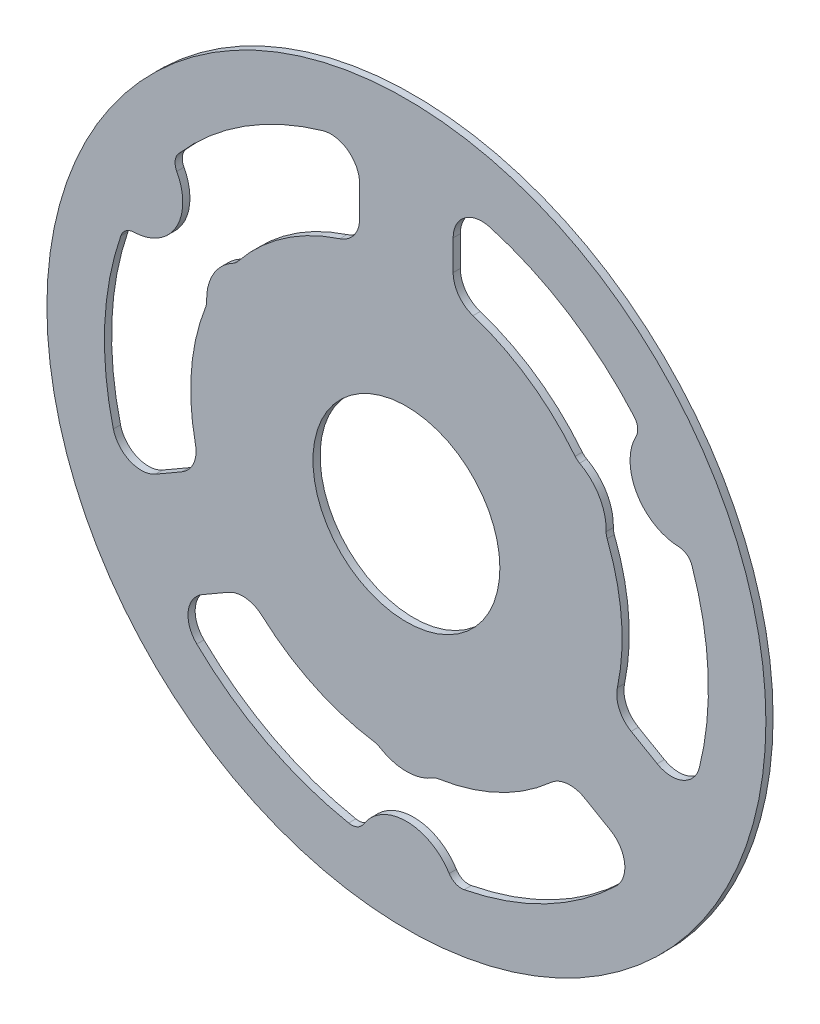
ISO-10303-21;
HEADER;
FILE_DESCRIPTION(('STEP AP214'),'2;1');
FILE_NAME('part.step','',(''),(''),'','','');
FILE_SCHEMA(('AUTOMOTIVE_DESIGN { 1 0 10303 214 1 1 1 1 }'));
ENDSEC;
DATA;
#1=APPLICATION_CONTEXT('core data for automotive mechanical design processes');
#2=APPLICATION_PROTOCOL_DEFINITION('international standard','automotive_design',2000,#1);
#3=PRODUCT_CONTEXT('',#1,'mechanical');
#4=PRODUCT('Part','Part','',(#3));
#5=PRODUCT_RELATED_PRODUCT_CATEGORY('part','',(#4));
#6=PRODUCT_DEFINITION_FORMATION('','',#4);
#7=PRODUCT_DEFINITION_CONTEXT('part definition',#1,'design');
#8=PRODUCT_DEFINITION('design','',#6,#7);
#9=PRODUCT_DEFINITION_SHAPE('','',#8);
#10=(LENGTH_UNIT() NAMED_UNIT(*) SI_UNIT(.MILLI.,.METRE.));
#11=(NAMED_UNIT(*) PLANE_ANGLE_UNIT() SI_UNIT($,.RADIAN.));
#12=(NAMED_UNIT(*) SI_UNIT($,.STERADIAN.) SOLID_ANGLE_UNIT());
#13=UNCERTAINTY_MEASURE_WITH_UNIT(LENGTH_MEASURE(1.E-05),#10,'distance_accuracy_value','');
#14=(GEOMETRIC_REPRESENTATION_CONTEXT(3) GLOBAL_UNCERTAINTY_ASSIGNED_CONTEXT((#13)) GLOBAL_UNIT_ASSIGNED_CONTEXT((#10,
#11,#12)) REPRESENTATION_CONTEXT('',''));
#15=CARTESIAN_POINT('',(0.,0.,0.));
#16=DIRECTION('',(0.,0.,1.));
#17=DIRECTION('',(1.,0.,0.));
#18=AXIS2_PLACEMENT_3D('',#15,#16,#17);
#19=CARTESIAN_POINT('',(0.,0.,0.5));
#20=DIRECTION('',(0.,0.,1.));
#21=DIRECTION('',(1.,0.,0.));
#22=AXIS2_PLACEMENT_3D('',#19,#20,#21);
#23=PLANE('',#22);
#24=CARTESIAN_POINT('',(-11.3777899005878,-12.6311478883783,0.5));
#25=DIRECTION('',(0.,0.,-1.));
#26=DIRECTION('',(-1.,0.,0.));
#27=AXIS2_PLACEMENT_3D('',#24,#25,#26);
#28=CIRCLE('',#27,2.);
#29=CARTESIAN_POINT('',(-12.3777899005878,-10.8990970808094,0.5));
#30=VERTEX_POINT('',#29);
#31=CARTESIAN_POINT('',(-10.0392263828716,-11.1451304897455,0.5));
#32=VERTEX_POINT('',#31);
#33=EDGE_CURVE('E557',#30,#32,#28,.T.);
#34=ORIENTED_EDGE('',*,*,#33,.T.);
#35=CARTESIAN_POINT('',(0.,0.,0.5));
#36=DIRECTION('',(0.,0.,-1.));
#37=DIRECTION('',(-1.,0.,0.));
#38=AXIS2_PLACEMENT_3D('',#35,#36,#37);
#39=CIRCLE('',#38,15.);
#40=CARTESIAN_POINT('',(-2.22551287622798,-14.833984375,0.5));
#41=VERTEX_POINT('',#40);
#42=EDGE_CURVE('E556',#41,#32,#39,.T.);
#43=ORIENTED_EDGE('',*,*,#42,.F.);
#44=CARTESIAN_POINT('',(-2.37388040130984,-15.8229166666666,0.5));
#45=DIRECTION('',(0.,0.,-1.));
#46=DIRECTION('',(-1.,0.,0.));
#47=AXIS2_PLACEMENT_3D('',#44,#45,#46);
#48=CIRCLE('',#47,1.);
#49=CARTESIAN_POINT('',(-1.84635142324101,-14.9733796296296,0.5));
#50=VERTEX_POINT('',#49);
#51=EDGE_CURVE('E596',#41,#50,#48,.T.);
#52=ORIENTED_EDGE('',*,*,#51,.T.);
#53=CARTESIAN_POINT('',(0.,-12.,0.5));
#54=DIRECTION('',(0.,0.,-1.));
#55=DIRECTION('',(-1.,0.,0.));
#56=AXIS2_PLACEMENT_3D('',#53,#54,#55);
#57=CIRCLE('',#56,3.5);
#58=CARTESIAN_POINT('',(1.84635142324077,-14.9733796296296,0.5));
#59=VERTEX_POINT('',#58);
#60=EDGE_CURVE('E594',#59,#50,#57,.T.);
#61=ORIENTED_EDGE('',*,*,#60,.F.);
#62=CARTESIAN_POINT('',(2.37388040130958,-15.8229166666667,0.5));
#63=DIRECTION('',(0.,0.,-1.));
#64=DIRECTION('',(-1.,0.,0.));
#65=AXIS2_PLACEMENT_3D('',#62,#63,#64);
#66=CIRCLE('',#65,0.999999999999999);
#67=CARTESIAN_POINT('',(2.22551287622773,-14.833984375,0.5));
#68=VERTEX_POINT('',#67);
#69=EDGE_CURVE('E591',#59,#68,#66,.T.);
#70=ORIENTED_EDGE('',*,*,#69,.T.);
#71=CARTESIAN_POINT('',(10.0392263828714,-11.1451304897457,0.5));
#72=VERTEX_POINT('',#71);
#73=EDGE_CURVE('E588',#72,#68,#39,.T.);
#74=ORIENTED_EDGE('',*,*,#73,.F.);
#75=CARTESIAN_POINT('',(11.3777899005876,-12.6311478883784,0.5));
#76=DIRECTION('',(0.,0.,1.));
#77=DIRECTION('',(1.,0.,0.));
#78=AXIS2_PLACEMENT_3D('',#75,#76,#77);
#79=CIRCLE('',#78,2.);
#80=CARTESIAN_POINT('',(12.3777899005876,-10.8990970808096,0.5));
#81=VERTEX_POINT('',#80);
#82=EDGE_CURVE('E585',#81,#72,#79,.T.);
#83=ORIENTED_EDGE('',*,*,#82,.F.);
#84=DIRECTION('',(0.866025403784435,-0.500000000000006,0.));
#85=VECTOR('',#84,1.);
#86=CARTESIAN_POINT('',(12.3777899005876,-10.8990970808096,0.5));
#87=LINE('',#86,#85);
#88=CARTESIAN_POINT('',(14.1888586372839,-11.9447181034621,0.5));
#89=VERTEX_POINT('',#88);
#90=EDGE_CURVE('E582',#81,#89,#87,.T.);
#91=ORIENTED_EDGE('',*,*,#90,.T.);
#92=CARTESIAN_POINT('',(13.1888586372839,-13.676768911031,0.5));
#93=DIRECTION('',(0.,0.,1.));
#94=DIRECTION('',(1.,0.,0.));
#95=AXIS2_PLACEMENT_3D('',#92,#93,#94);
#96=CIRCLE('',#95,1.99999999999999);
#97=CARTESIAN_POINT('',(14.5771595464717,-15.1164287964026,0.5));
#98=VERTEX_POINT('',#97);
#99=EDGE_CURVE('E579',#98,#89,#96,.T.);
#100=ORIENTED_EDGE('',*,*,#99,.F.);
#101=CARTESIAN_POINT('',(0.,0.,0.5));
#102=DIRECTION('',(0.,0.,-1.));
#103=DIRECTION('',(-1.,0.,0.));
#104=AXIS2_PLACEMENT_3D('',#101,#102,#103);
#105=CIRCLE('',#104,21.);
#106=CARTESIAN_POINT('',(4.01703314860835,-20.6122159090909,0.5));
#107=VERTEX_POINT('',#106);
#108=EDGE_CURVE('E576',#98,#107,#105,.T.);
#109=ORIENTED_EDGE('',*,*,#108,.T.);
#110=CARTESIAN_POINT('',(3.82574585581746,-19.6306818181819,0.5));
#111=DIRECTION('',(0.,0.,-1.));
#112=DIRECTION('',(-1.,0.,0.));
#113=AXIS2_PLACEMENT_3D('',#110,#111,#112);
#114=CIRCLE('',#113,0.999999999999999);
#115=CARTESIAN_POINT('',(2.97558011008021,-20.157196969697,0.5));
#116=VERTEX_POINT('',#115);
#117=EDGE_CURVE('E573',#107,#116,#114,.T.);
#118=ORIENTED_EDGE('',*,*,#117,.T.);
#119=CARTESIAN_POINT('',(-1.66533453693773E-13,-22.,0.5));
#120=DIRECTION('',(0.,0.,-1.));
#121=DIRECTION('',(-1.,0.,0.));
#122=AXIS2_PLACEMENT_3D('',#119,#120,#121);
#123=CIRCLE('',#122,3.49999999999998);
#124=CARTESIAN_POINT('',(-2.97558011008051,-20.157196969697,0.5));
#125=VERTEX_POINT('',#124);
#126=EDGE_CURVE('E570',#125,#116,#123,.T.);
#127=ORIENTED_EDGE('',*,*,#126,.F.);
#128=CARTESIAN_POINT('',(-3.82574585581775,-19.6306818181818,0.5));
#129=DIRECTION('',(0.,0.,1.));
#130=DIRECTION('',(1.,0.,0.));
#131=AXIS2_PLACEMENT_3D('',#128,#129,#130);
#132=CIRCLE('',#131,1.);
#133=CARTESIAN_POINT('',(-4.01703314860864,-20.6122159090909,0.5));
#134=VERTEX_POINT('',#133);
#135=EDGE_CURVE('E567',#134,#125,#132,.T.);
#136=ORIENTED_EDGE('',*,*,#135,.F.);
#137=CARTESIAN_POINT('',(-14.5771595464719,-15.1164287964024,0.5));
#138=VERTEX_POINT('',#137);
#139=EDGE_CURVE('E566',#134,#138,#105,.T.);
#140=ORIENTED_EDGE('',*,*,#139,.T.);
#141=CARTESIAN_POINT('',(-13.1888586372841,-13.6767689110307,0.5));
#142=DIRECTION('',(0.,0.,-1.));
#143=DIRECTION('',(-1.,0.,0.));
#144=AXIS2_PLACEMENT_3D('',#141,#142,#143);
#145=CIRCLE('',#144,2.);
#146=CARTESIAN_POINT('',(-14.1888586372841,-11.9447181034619,0.5));
#147=VERTEX_POINT('',#146);
#148=EDGE_CURVE('E563',#138,#147,#145,.T.);
#149=ORIENTED_EDGE('',*,*,#148,.T.);
#150=DIRECTION('',(-0.866025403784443,-0.499999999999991,0.));
#151=VECTOR('',#150,1.);
#152=CARTESIAN_POINT('',(-12.3777899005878,-10.8990970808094,0.5));
#153=LINE('',#152,#151);
#154=EDGE_CURVE('E560',#30,#147,#153,.T.);
#155=ORIENTED_EDGE('',*,*,#154,.F.);
#156=EDGE_LOOP('',(#34,#43,#52,#61,#70,#74,#83,#91,#100,#109,#118,#127,#136,#140,#149,#155));
#157=FACE_BOUND('',#156,.T.);
#158=CARTESIAN_POINT('',(5.25,18.2602710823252,0.5));
#159=DIRECTION('',(0.,0.,1.));
#160=DIRECTION('',(1.,0.,0.));
#161=AXIS2_PLACEMENT_3D('',#158,#159,#160);
#162=CIRCLE('',#161,2.);
#163=CARTESIAN_POINT('',(5.80263157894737,20.1824048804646,0.5));
#164=VERTEX_POINT('',#163);
#165=CARTESIAN_POINT('',(3.25,18.2602710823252,0.5));
#166=VERTEX_POINT('',#165);
#167=EDGE_CURVE('E683',#164,#166,#162,.T.);
#168=ORIENTED_EDGE('',*,*,#167,.F.);
#169=CARTESIAN_POINT('',(0.,0.,0.5));
#170=DIRECTION('',(0.,0.,1.));
#171=DIRECTION('',(1.,0.,0.));
#172=AXIS2_PLACEMENT_3D('',#169,#170,#171);
#173=CIRCLE('',#172,21.);
#174=CARTESIAN_POINT('',(15.8421860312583,13.7849607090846,0.5));
#175=VERTEX_POINT('',#174);
#176=EDGE_CURVE('E682',#175,#164,#173,.T.);
#177=ORIENTED_EDGE('',*,*,#176,.F.);
#178=CARTESIAN_POINT('',(15.087796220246,13.128534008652,0.5));
#179=DIRECTION('',(0.,0.,-1.));
#180=DIRECTION('',(-1.,0.,0.));
#181=AXIS2_PLACEMENT_3D('',#178,#179,#180);
#182=CIRCLE('',#181,1.);
#183=CARTESIAN_POINT('',(15.9688545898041,12.6555264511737,0.5));
#184=VERTEX_POINT('',#183);
#185=EDGE_CURVE('E723',#175,#184,#182,.T.);
#186=ORIENTED_EDGE('',*,*,#185,.T.);
#187=CARTESIAN_POINT('',(19.0525588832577,11.,0.5));
#188=DIRECTION('',(0.,0.,1.));
#189=DIRECTION('',(1.,0.,0.));
#190=AXIS2_PLACEMENT_3D('',#187,#188,#189);
#191=CIRCLE('',#190,3.49999999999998);
#192=CARTESIAN_POINT('',(18.9444346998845,7.50167051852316,0.5));
#193=VERTEX_POINT('',#192);
#194=EDGE_CURVE('E720',#184,#193,#191,.T.);
#195=ORIENTED_EDGE('',*,*,#194,.T.);
#196=CARTESIAN_POINT('',(18.9135420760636,6.50214780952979,0.5));
#197=DIRECTION('',(0.,0.,1.));
#198=DIRECTION('',(1.,0.,0.));
#199=AXIS2_PLACEMENT_3D('',#196,#197,#198);
#200=CIRCLE('',#199,1.);
#201=CARTESIAN_POINT('',(19.8592191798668,6.82725520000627,0.5));
#202=VERTEX_POINT('',#201);
#203=EDGE_CURVE('E717',#202,#193,#200,.T.);
#204=ORIENTED_EDGE('',*,*,#203,.F.);
#205=CARTESIAN_POINT('',(20.3797911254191,-5.06597608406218,0.5));
#206=VERTEX_POINT('',#205);
#207=EDGE_CURVE('E714',#206,#202,#173,.T.);
#208=ORIENTED_EDGE('',*,*,#207,.F.);
#209=CARTESIAN_POINT('',(18.4388586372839,-4.58350217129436,0.5));
#210=DIRECTION('',(0.,0.,-1.));
#211=DIRECTION('',(-1.,0.,0.));
#212=AXIS2_PLACEMENT_3D('',#209,#210,#211);
#213=CIRCLE('',#212,2.);
#214=CARTESIAN_POINT('',(17.4388586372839,-6.31555297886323,0.5));
#215=VERTEX_POINT('',#214);
#216=EDGE_CURVE('E711',#206,#215,#213,.T.);
#217=ORIENTED_EDGE('',*,*,#216,.T.);
#218=DIRECTION('',(0.866025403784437,-0.500000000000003,0.));
#219=VECTOR('',#218,1.);
#220=CARTESIAN_POINT('',(15.6277899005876,-5.26993195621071,0.5));
#221=LINE('',#220,#219);
#222=CARTESIAN_POINT('',(15.6277899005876,-5.26993195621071,0.5));
#223=VERTEX_POINT('',#222);
#224=EDGE_CURVE('E708',#223,#215,#221,.T.);
#225=ORIENTED_EDGE('',*,*,#224,.F.);
#226=CARTESIAN_POINT('',(16.6277899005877,-3.53788114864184,0.5));
#227=DIRECTION('',(0.,0.,-1.));
#228=DIRECTION('',(-1.,0.,0.));
#229=AXIS2_PLACEMENT_3D('',#226,#227,#228);
#230=CIRCLE('',#229,2.);
#231=CARTESIAN_POINT('',(14.6715793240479,-3.12165983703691,0.5));
#232=VERTEX_POINT('',#231);
#233=EDGE_CURVE('E705',#223,#232,#230,.T.);
#234=ORIENTED_EDGE('',*,*,#233,.T.);
#235=CARTESIAN_POINT('',(0.,0.,0.5));
#236=DIRECTION('',(0.,0.,1.));
#237=DIRECTION('',(1.,0.,0.));
#238=AXIS2_PLACEMENT_3D('',#235,#236,#237);
#239=CIRCLE('',#238,15.);
#240=CARTESIAN_POINT('',(13.9593637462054,5.48964150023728,0.5));
#241=VERTEX_POINT('',#240);
#242=EDGE_CURVE('E702',#232,#241,#239,.T.);
#243=ORIENTED_EDGE('',*,*,#242,.T.);
#244=CARTESIAN_POINT('',(14.8899879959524,5.8556176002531,0.5));
#245=DIRECTION('',(0.,0.,1.));
#246=DIRECTION('',(1.,0.,0.));
#247=AXIS2_PLACEMENT_3D('',#244,#245,#246);
#248=CIRCLE('',#247,1.);
#249=CARTESIAN_POINT('',(13.8905028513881,5.88770257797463,0.5));
#250=VERTEX_POINT('',#249);
#251=EDGE_CURVE('E699',#250,#241,#248,.T.);
#252=ORIENTED_EDGE('',*,*,#251,.F.);
#253=CARTESIAN_POINT('',(10.3923048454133,5.99999999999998,0.5));
#254=DIRECTION('',(0.,0.,1.));
#255=DIRECTION('',(1.,0.,0.));
#256=AXIS2_PLACEMENT_3D('',#253,#254,#255);
#257=CIRCLE('',#256,3.5);
#258=CARTESIAN_POINT('',(12.0441514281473,9.08567705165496,0.5));
#259=VERTEX_POINT('',#258);
#260=EDGE_CURVE('E696',#250,#259,#257,.T.);
#261=ORIENTED_EDGE('',*,*,#260,.T.);
#262=CARTESIAN_POINT('',(12.5161075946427,9.96729906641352,0.5));
#263=DIRECTION('',(0.,0.,1.));
#264=DIRECTION('',(1.,0.,0.));
#265=AXIS2_PLACEMENT_3D('',#262,#263,#264);
#266=CIRCLE('',#265,1.);
#267=CARTESIAN_POINT('',(11.7338508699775,9.34434287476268,0.5));
#268=VERTEX_POINT('',#267);
#269=EDGE_CURVE('E693',#268,#259,#266,.T.);
#270=ORIENTED_EDGE('',*,*,#269,.F.);
#271=CARTESIAN_POINT('',(4.63235294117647,14.2667903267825,0.5));
#272=VERTEX_POINT('',#271);
#273=EDGE_CURVE('E692',#268,#272,#239,.T.);
#274=ORIENTED_EDGE('',*,*,#273,.T.);
#275=CARTESIAN_POINT('',(5.25,16.1690290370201,0.5));
#276=DIRECTION('',(0.,0.,1.));
#277=DIRECTION('',(1.,0.,0.));
#278=AXIS2_PLACEMENT_3D('',#275,#276,#277);
#279=CIRCLE('',#278,2.);
#280=CARTESIAN_POINT('',(3.25,16.1690290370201,0.5));
#281=VERTEX_POINT('',#280);
#282=EDGE_CURVE('E689',#281,#272,#279,.T.);
#283=ORIENTED_EDGE('',*,*,#282,.F.);
#284=DIRECTION('',(0.,1.,0.));
#285=VECTOR('',#284,1.);
#286=CARTESIAN_POINT('',(3.25,16.1690290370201,0.5));
#287=LINE('',#286,#285);
#288=EDGE_CURVE('E686',#281,#166,#287,.T.);
#289=ORIENTED_EDGE('',*,*,#288,.T.);
#290=EDGE_LOOP('',(#168,#177,#186,#195,#204,#208,#217,#225,#234,#243,#252,#261,#270,#274,#283,#289));
#291=FACE_BOUND('',#290,.T.);
#292=CARTESIAN_POINT('',(0.,0.,0.5));
#293=DIRECTION('',(0.,0.,1.));
#294=DIRECTION('',(1.,0.,0.));
#295=AXIS2_PLACEMENT_3D('',#292,#293,#294);
#296=CIRCLE('',#295,25.);
#297=CARTESIAN_POINT('',(25.,0.,0.5));
#298=VERTEX_POINT('',#297);
#299=EDGE_CURVE('E11',#298,#298,#296,.T.);
#300=ORIENTED_EDGE('',*,*,#299,.T.);
#301=EDGE_LOOP('',(#300));
#302=FACE_BOUND('',#301,.T.);
#303=CARTESIAN_POINT('',(0.,0.,0.5));
#304=DIRECTION('',(0.,0.,1.));
#305=DIRECTION('',(1.,0.,0.));
#306=AXIS2_PLACEMENT_3D('',#303,#304,#305);
#307=CIRCLE('',#306,6.5);
#308=CARTESIAN_POINT('',(6.5,0.,0.5));
#309=VERTEX_POINT('',#308);
#310=EDGE_CURVE('E635',#309,#309,#307,.T.);
#311=ORIENTED_EDGE('',*,*,#310,.F.);
#312=EDGE_LOOP('',(#311));
#313=FACE_BOUND('',#312,.T.);
#314=CARTESIAN_POINT('',(-5.25,16.1690290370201,0.5));
#315=DIRECTION('',(0.,0.,-1.));
#316=DIRECTION('',(-1.,0.,0.));
#317=AXIS2_PLACEMENT_3D('',#314,#315,#316);
#318=CIRCLE('',#317,2.);
#319=CARTESIAN_POINT('',(-3.25,16.1690290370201,0.5));
#320=VERTEX_POINT('',#319);
#321=CARTESIAN_POINT('',(-4.63235294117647,14.2667903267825,0.5));
#322=VERTEX_POINT('',#321);
#323=EDGE_CURVE('E485',#320,#322,#318,.T.);
#324=ORIENTED_EDGE('',*,*,#323,.T.);
#325=CARTESIAN_POINT('',(0.,0.,0.5));
#326=DIRECTION('',(0.,0.,-1.));
#327=DIRECTION('',(-1.,0.,0.));
#328=AXIS2_PLACEMENT_3D('',#325,#326,#327);
#329=CIRCLE('',#328,15.);
#330=CARTESIAN_POINT('',(-11.7338508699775,9.34434287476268,0.5));
#331=VERTEX_POINT('',#330);
#332=EDGE_CURVE('E338',#331,#322,#329,.T.);
#333=ORIENTED_EDGE('',*,*,#332,.F.);
#334=CARTESIAN_POINT('',(-12.5161075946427,9.96729906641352,0.5));
#335=DIRECTION('',(0.,0.,-1.));
#336=DIRECTION('',(-1.,0.,0.));
#337=AXIS2_PLACEMENT_3D('',#334,#335,#336);
#338=CIRCLE('',#337,1.);
#339=CARTESIAN_POINT('',(-12.0441514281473,9.08567705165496,0.5));
#340=VERTEX_POINT('',#339);
#341=EDGE_CURVE('E502',#331,#340,#338,.T.);
#342=ORIENTED_EDGE('',*,*,#341,.T.);
#343=CARTESIAN_POINT('',(-10.3923048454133,5.99999999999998,0.5));
#344=DIRECTION('',(0.,0.,-1.));
#345=DIRECTION('',(-1.,0.,0.));
#346=AXIS2_PLACEMENT_3D('',#343,#344,#345);
#347=CIRCLE('',#346,3.5);
#348=CARTESIAN_POINT('',(-13.8905028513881,5.88770257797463,0.5));
#349=VERTEX_POINT('',#348);
#350=EDGE_CURVE('E46',#349,#340,#347,.T.);
#351=ORIENTED_EDGE('',*,*,#350,.F.);
#352=CARTESIAN_POINT('',(-14.8899879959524,5.8556176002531,0.5));
#353=DIRECTION('',(0.,0.,-1.));
#354=DIRECTION('',(-1.,0.,0.));
#355=AXIS2_PLACEMENT_3D('',#352,#353,#354);
#356=CIRCLE('',#355,1.);
#357=CARTESIAN_POINT('',(-13.9593637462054,5.48964150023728,0.5));
#358=VERTEX_POINT('',#357);
#359=EDGE_CURVE('E499',#349,#358,#356,.T.);
#360=ORIENTED_EDGE('',*,*,#359,.T.);
#361=CARTESIAN_POINT('',(-14.6715793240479,-3.12165983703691,0.5));
#362=VERTEX_POINT('',#361);
#363=EDGE_CURVE('E474',#362,#358,#329,.T.);
#364=ORIENTED_EDGE('',*,*,#363,.F.);
#365=CARTESIAN_POINT('',(-16.6277899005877,-3.53788114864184,0.5));
#366=DIRECTION('',(0.,0.,1.));
#367=DIRECTION('',(1.,0.,0.));
#368=AXIS2_PLACEMENT_3D('',#365,#366,#367);
#369=CIRCLE('',#368,2.);
#370=CARTESIAN_POINT('',(-15.6277899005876,-5.26993195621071,0.5));
#371=VERTEX_POINT('',#370);
#372=EDGE_CURVE('E467',#371,#362,#369,.T.);
#373=ORIENTED_EDGE('',*,*,#372,.F.);
#374=DIRECTION('',(-0.866025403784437,-0.500000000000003,0.));
#375=VECTOR('',#374,1.);
#376=CARTESIAN_POINT('',(-15.6277899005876,-5.26993195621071,0.5));
#377=LINE('',#376,#375);
#378=CARTESIAN_POINT('',(-17.4388586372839,-6.31555297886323,0.5));
#379=VERTEX_POINT('',#378);
#380=EDGE_CURVE('E460',#371,#379,#377,.T.);
#381=ORIENTED_EDGE('',*,*,#380,.T.);
#382=CARTESIAN_POINT('',(-18.4388586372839,-4.58350217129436,0.5));
#383=DIRECTION('',(0.,0.,1.));
#384=DIRECTION('',(1.,0.,0.));
#385=AXIS2_PLACEMENT_3D('',#382,#383,#384);
#386=CIRCLE('',#385,2.);
#387=CARTESIAN_POINT('',(-20.3797911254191,-5.06597608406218,0.5));
#388=VERTEX_POINT('',#387);
#389=EDGE_CURVE('E453',#388,#379,#386,.T.);
#390=ORIENTED_EDGE('',*,*,#389,.F.);
#391=CARTESIAN_POINT('',(0.,0.,0.5));
#392=DIRECTION('',(0.,0.,-1.));
#393=DIRECTION('',(-1.,0.,0.));
#394=AXIS2_PLACEMENT_3D('',#391,#392,#393);
#395=CIRCLE('',#394,21.);
#396=CARTESIAN_POINT('',(-19.8592191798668,6.82725520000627,0.5));
#397=VERTEX_POINT('',#396);
#398=EDGE_CURVE('E446',#388,#397,#395,.T.);
#399=ORIENTED_EDGE('',*,*,#398,.T.);
#400=CARTESIAN_POINT('',(-18.9135420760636,6.50214780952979,0.5));
#401=DIRECTION('',(0.,0.,-1.));
#402=DIRECTION('',(-1.,0.,0.));
#403=AXIS2_PLACEMENT_3D('',#400,#401,#402);
#404=CIRCLE('',#403,1.);
#405=CARTESIAN_POINT('',(-18.9444346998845,7.50167051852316,0.5));
#406=VERTEX_POINT('',#405);
#407=EDGE_CURVE('E492',#397,#406,#404,.T.);
#408=ORIENTED_EDGE('',*,*,#407,.T.);
#409=CARTESIAN_POINT('',(-19.0525588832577,11.,0.5));
#410=DIRECTION('',(0.,0.,-1.));
#411=DIRECTION('',(-1.,0.,0.));
#412=AXIS2_PLACEMENT_3D('',#409,#410,#411);
#413=CIRCLE('',#412,3.49999999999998);
#414=CARTESIAN_POINT('',(-15.9688545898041,12.6555264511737,0.5));
#415=VERTEX_POINT('',#414);
#416=EDGE_CURVE('E432',#415,#406,#413,.T.);
#417=ORIENTED_EDGE('',*,*,#416,.F.);
#418=CARTESIAN_POINT('',(-15.087796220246,13.128534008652,0.5));
#419=DIRECTION('',(0.,0.,1.));
#420=DIRECTION('',(1.,0.,0.));
#421=AXIS2_PLACEMENT_3D('',#418,#419,#420);
#422=CIRCLE('',#421,1.);
#423=CARTESIAN_POINT('',(-15.8421860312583,13.7849607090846,0.5));
#424=VERTEX_POINT('',#423);
#425=EDGE_CURVE('E425',#424,#415,#422,.T.);
#426=ORIENTED_EDGE('',*,*,#425,.F.);
#427=CARTESIAN_POINT('',(-5.80263157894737,20.1824048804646,0.5));
#428=VERTEX_POINT('',#427);
#429=EDGE_CURVE('E489',#424,#428,#395,.T.);
#430=ORIENTED_EDGE('',*,*,#429,.T.);
#431=CARTESIAN_POINT('',(-5.25,18.2602710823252,0.5));
#432=DIRECTION('',(0.,0.,-1.));
#433=DIRECTION('',(-1.,0.,0.));
#434=AXIS2_PLACEMENT_3D('',#431,#432,#433);
#435=CIRCLE('',#434,2.);
#436=CARTESIAN_POINT('',(-3.25,18.2602710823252,0.5));
#437=VERTEX_POINT('',#436);
#438=EDGE_CURVE('E410',#428,#437,#435,.T.);
#439=ORIENTED_EDGE('',*,*,#438,.T.);
#440=DIRECTION('',(0.,1.,0.));
#441=VECTOR('',#440,1.);
#442=CARTESIAN_POINT('',(-3.25,16.1690290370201,0.5));
#443=LINE('',#442,#441);
#444=EDGE_CURVE('E402',#320,#437,#443,.T.);
#445=ORIENTED_EDGE('',*,*,#444,.F.);
#446=EDGE_LOOP('',(#324,#333,#342,#351,#360,#364,#373,#381,#390,#399,#408,#417,#426,#430,#439,#445));
#447=FACE_BOUND('',#446,.T.);
#448=ADVANCED_FACE('F31',(#157,#291,#302,#313,#447),#23,.T.);
#449=CARTESIAN_POINT('',(0.,0.,0.));
#450=DIRECTION('',(0.,0.,1.));
#451=DIRECTION('',(1.,0.,0.));
#452=AXIS2_PLACEMENT_3D('',#449,#450,#451);
#453=PLANE('',#452);
#454=CARTESIAN_POINT('',(0.,0.,0.));
#455=DIRECTION('',(0.,0.,-1.));
#456=DIRECTION('',(-1.,0.,0.));
#457=AXIS2_PLACEMENT_3D('',#454,#455,#456);
#458=CIRCLE('',#457,15.);
#459=CARTESIAN_POINT('',(-2.22551287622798,-14.833984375,0.));
#460=VERTEX_POINT('',#459);
#461=CARTESIAN_POINT('',(-10.0392263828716,-11.1451304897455,0.));
#462=VERTEX_POINT('',#461);
#463=EDGE_CURVE('E342',#460,#462,#458,.T.);
#464=ORIENTED_EDGE('',*,*,#463,.T.);
#465=CARTESIAN_POINT('',(-11.3777899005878,-12.6311478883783,0.));
#466=DIRECTION('',(0.,0.,-1.));
#467=DIRECTION('',(-1.,0.,0.));
#468=AXIS2_PLACEMENT_3D('',#465,#466,#467);
#469=CIRCLE('',#468,2.);
#470=CARTESIAN_POINT('',(-12.3777899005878,-10.8990970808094,0.));
#471=VERTEX_POINT('',#470);
#472=EDGE_CURVE('E513',#471,#462,#469,.T.);
#473=ORIENTED_EDGE('',*,*,#472,.F.);
#474=DIRECTION('',(-0.866025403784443,-0.499999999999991,0.));
#475=VECTOR('',#474,1.);
#476=CARTESIAN_POINT('',(-12.3777899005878,-10.8990970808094,0.));
#477=LINE('',#476,#475);
#478=CARTESIAN_POINT('',(-14.1888586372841,-11.9447181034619,0.));
#479=VERTEX_POINT('',#478);
#480=EDGE_CURVE('E516',#471,#479,#477,.T.);
#481=ORIENTED_EDGE('',*,*,#480,.T.);
#482=CARTESIAN_POINT('',(-13.1888586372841,-13.6767689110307,0.));
#483=DIRECTION('',(0.,0.,-1.));
#484=DIRECTION('',(-1.,0.,0.));
#485=AXIS2_PLACEMENT_3D('',#482,#483,#484);
#486=CIRCLE('',#485,2.);
#487=CARTESIAN_POINT('',(-14.5771595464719,-15.1164287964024,0.));
#488=VERTEX_POINT('',#487);
#489=EDGE_CURVE('E519',#488,#479,#486,.T.);
#490=ORIENTED_EDGE('',*,*,#489,.F.);
#491=CARTESIAN_POINT('',(0.,0.,0.));
#492=DIRECTION('',(0.,0.,-1.));
#493=DIRECTION('',(-1.,0.,0.));
#494=AXIS2_PLACEMENT_3D('',#491,#492,#493);
#495=CIRCLE('',#494,21.);
#496=CARTESIAN_POINT('',(-4.01703314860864,-20.6122159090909,0.));
#497=VERTEX_POINT('',#496);
#498=EDGE_CURVE('E522',#497,#488,#495,.T.);
#499=ORIENTED_EDGE('',*,*,#498,.F.);
#500=CARTESIAN_POINT('',(-3.82574585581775,-19.6306818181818,0.));
#501=DIRECTION('',(0.,0.,1.));
#502=DIRECTION('',(1.,0.,0.));
#503=AXIS2_PLACEMENT_3D('',#500,#501,#502);
#504=CIRCLE('',#503,1.);
#505=CARTESIAN_POINT('',(-2.97558011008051,-20.157196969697,0.));
#506=VERTEX_POINT('',#505);
#507=EDGE_CURVE('E523',#497,#506,#504,.T.);
#508=ORIENTED_EDGE('',*,*,#507,.T.);
#509=CARTESIAN_POINT('',(-1.66533453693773E-13,-22.,0.));
#510=DIRECTION('',(0.,0.,-1.));
#511=DIRECTION('',(-1.,0.,0.));
#512=AXIS2_PLACEMENT_3D('',#509,#510,#511);
#513=CIRCLE('',#512,3.49999999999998);
#514=CARTESIAN_POINT('',(2.97558011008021,-20.157196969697,0.));
#515=VERTEX_POINT('',#514);
#516=EDGE_CURVE('E526',#506,#515,#513,.T.);
#517=ORIENTED_EDGE('',*,*,#516,.T.);
#518=CARTESIAN_POINT('',(3.82574585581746,-19.6306818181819,0.));
#519=DIRECTION('',(0.,0.,-1.));
#520=DIRECTION('',(-1.,0.,0.));
#521=AXIS2_PLACEMENT_3D('',#518,#519,#520);
#522=CIRCLE('',#521,0.999999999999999);
#523=CARTESIAN_POINT('',(4.01703314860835,-20.6122159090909,0.));
#524=VERTEX_POINT('',#523);
#525=EDGE_CURVE('E529',#524,#515,#522,.T.);
#526=ORIENTED_EDGE('',*,*,#525,.F.);
#527=CARTESIAN_POINT('',(14.5771595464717,-15.1164287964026,0.));
#528=VERTEX_POINT('',#527);
#529=EDGE_CURVE('E532',#528,#524,#495,.T.);
#530=ORIENTED_EDGE('',*,*,#529,.F.);
#531=CARTESIAN_POINT('',(13.1888586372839,-13.676768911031,0.));
#532=DIRECTION('',(0.,0.,1.));
#533=DIRECTION('',(1.,0.,0.));
#534=AXIS2_PLACEMENT_3D('',#531,#532,#533);
#535=CIRCLE('',#534,1.99999999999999);
#536=CARTESIAN_POINT('',(14.1888586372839,-11.9447181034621,0.));
#537=VERTEX_POINT('',#536);
#538=EDGE_CURVE('E535',#528,#537,#535,.T.);
#539=ORIENTED_EDGE('',*,*,#538,.T.);
#540=DIRECTION('',(0.866025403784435,-0.500000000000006,0.));
#541=VECTOR('',#540,1.);
#542=CARTESIAN_POINT('',(12.3777899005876,-10.8990970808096,0.));
#543=LINE('',#542,#541);
#544=CARTESIAN_POINT('',(12.3777899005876,-10.8990970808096,0.));
#545=VERTEX_POINT('',#544);
#546=EDGE_CURVE('E538',#545,#537,#543,.T.);
#547=ORIENTED_EDGE('',*,*,#546,.F.);
#548=CARTESIAN_POINT('',(11.3777899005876,-12.6311478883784,0.));
#549=DIRECTION('',(0.,0.,1.));
#550=DIRECTION('',(1.,0.,0.));
#551=AXIS2_PLACEMENT_3D('',#548,#549,#550);
#552=CIRCLE('',#551,2.);
#553=CARTESIAN_POINT('',(10.0392263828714,-11.1451304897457,0.));
#554=VERTEX_POINT('',#553);
#555=EDGE_CURVE('E541',#545,#554,#552,.T.);
#556=ORIENTED_EDGE('',*,*,#555,.T.);
#557=CARTESIAN_POINT('',(2.22551287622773,-14.833984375,0.));
#558=VERTEX_POINT('',#557);
#559=EDGE_CURVE('E544',#554,#558,#458,.T.);
#560=ORIENTED_EDGE('',*,*,#559,.T.);
#561=CARTESIAN_POINT('',(2.37388040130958,-15.8229166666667,0.));
#562=DIRECTION('',(0.,0.,-1.));
#563=DIRECTION('',(-1.,0.,0.));
#564=AXIS2_PLACEMENT_3D('',#561,#562,#563);
#565=CIRCLE('',#564,0.999999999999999);
#566=CARTESIAN_POINT('',(1.84635142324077,-14.9733796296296,0.));
#567=VERTEX_POINT('',#566);
#568=EDGE_CURVE('E547',#567,#558,#565,.T.);
#569=ORIENTED_EDGE('',*,*,#568,.F.);
#570=CARTESIAN_POINT('',(0.,-12.,0.));
#571=DIRECTION('',(0.,0.,-1.));
#572=DIRECTION('',(-1.,0.,0.));
#573=AXIS2_PLACEMENT_3D('',#570,#571,#572);
#574=CIRCLE('',#573,3.5);
#575=CARTESIAN_POINT('',(-1.84635142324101,-14.9733796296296,0.));
#576=VERTEX_POINT('',#575);
#577=EDGE_CURVE('E550',#567,#576,#574,.T.);
#578=ORIENTED_EDGE('',*,*,#577,.T.);
#579=CARTESIAN_POINT('',(-2.37388040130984,-15.8229166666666,0.));
#580=DIRECTION('',(0.,0.,-1.));
#581=DIRECTION('',(-1.,0.,0.));
#582=AXIS2_PLACEMENT_3D('',#579,#580,#581);
#583=CIRCLE('',#582,1.);
#584=EDGE_CURVE('E553',#460,#576,#583,.T.);
#585=ORIENTED_EDGE('',*,*,#584,.F.);
#586=EDGE_LOOP('',(#464,#473,#481,#490,#499,#508,#517,#526,#530,#539,#547,#556,#560,#569,#578,#585));
#587=FACE_BOUND('',#586,.T.);
#588=CARTESIAN_POINT('',(0.,0.,0.));
#589=DIRECTION('',(0.,0.,1.));
#590=DIRECTION('',(1.,0.,0.));
#591=AXIS2_PLACEMENT_3D('',#588,#589,#590);
#592=CIRCLE('',#591,21.);
#593=CARTESIAN_POINT('',(15.8421860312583,13.7849607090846,0.));
#594=VERTEX_POINT('',#593);
#595=CARTESIAN_POINT('',(5.80263157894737,20.1824048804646,0.));
#596=VERTEX_POINT('',#595);
#597=EDGE_CURVE('E638',#594,#596,#592,.T.);
#598=ORIENTED_EDGE('',*,*,#597,.T.);
#599=CARTESIAN_POINT('',(5.25,18.2602710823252,0.));
#600=DIRECTION('',(0.,0.,1.));
#601=DIRECTION('',(1.,0.,0.));
#602=AXIS2_PLACEMENT_3D('',#599,#600,#601);
#603=CIRCLE('',#602,2.);
#604=CARTESIAN_POINT('',(3.25,18.2602710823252,0.));
#605=VERTEX_POINT('',#604);
#606=EDGE_CURVE('E639',#596,#605,#603,.T.);
#607=ORIENTED_EDGE('',*,*,#606,.T.);
#608=DIRECTION('',(0.,1.,0.));
#609=VECTOR('',#608,1.);
#610=CARTESIAN_POINT('',(3.25,16.1690290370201,0.));
#611=LINE('',#610,#609);
#612=CARTESIAN_POINT('',(3.25,16.1690290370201,0.));
#613=VERTEX_POINT('',#612);
#614=EDGE_CURVE('E642',#613,#605,#611,.T.);
#615=ORIENTED_EDGE('',*,*,#614,.F.);
#616=CARTESIAN_POINT('',(5.25,16.1690290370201,0.));
#617=DIRECTION('',(0.,0.,1.));
#618=DIRECTION('',(1.,0.,0.));
#619=AXIS2_PLACEMENT_3D('',#616,#617,#618);
#620=CIRCLE('',#619,2.);
#621=CARTESIAN_POINT('',(4.63235294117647,14.2667903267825,0.));
#622=VERTEX_POINT('',#621);
#623=EDGE_CURVE('E645',#613,#622,#620,.T.);
#624=ORIENTED_EDGE('',*,*,#623,.T.);
#625=CARTESIAN_POINT('',(0.,0.,0.));
#626=DIRECTION('',(0.,0.,1.));
#627=DIRECTION('',(1.,0.,0.));
#628=AXIS2_PLACEMENT_3D('',#625,#626,#627);
#629=CIRCLE('',#628,15.);
#630=CARTESIAN_POINT('',(11.7338508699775,9.34434287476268,0.));
#631=VERTEX_POINT('',#630);
#632=EDGE_CURVE('E648',#631,#622,#629,.T.);
#633=ORIENTED_EDGE('',*,*,#632,.F.);
#634=CARTESIAN_POINT('',(12.5161075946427,9.96729906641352,0.));
#635=DIRECTION('',(0.,0.,1.));
#636=DIRECTION('',(1.,0.,0.));
#637=AXIS2_PLACEMENT_3D('',#634,#635,#636);
#638=CIRCLE('',#637,1.);
#639=CARTESIAN_POINT('',(12.0441514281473,9.08567705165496,0.));
#640=VERTEX_POINT('',#639);
#641=EDGE_CURVE('E649',#631,#640,#638,.T.);
#642=ORIENTED_EDGE('',*,*,#641,.T.);
#643=CARTESIAN_POINT('',(10.3923048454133,5.99999999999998,0.));
#644=DIRECTION('',(0.,0.,1.));
#645=DIRECTION('',(1.,0.,0.));
#646=AXIS2_PLACEMENT_3D('',#643,#644,#645);
#647=CIRCLE('',#646,3.5);
#648=CARTESIAN_POINT('',(13.8905028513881,5.88770257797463,0.));
#649=VERTEX_POINT('',#648);
#650=EDGE_CURVE('E652',#649,#640,#647,.T.);
#651=ORIENTED_EDGE('',*,*,#650,.F.);
#652=CARTESIAN_POINT('',(14.8899879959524,5.8556176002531,0.));
#653=DIRECTION('',(0.,0.,1.));
#654=DIRECTION('',(1.,0.,0.));
#655=AXIS2_PLACEMENT_3D('',#652,#653,#654);
#656=CIRCLE('',#655,1.);
#657=CARTESIAN_POINT('',(13.9593637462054,5.48964150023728,0.));
#658=VERTEX_POINT('',#657);
#659=EDGE_CURVE('E655',#649,#658,#656,.T.);
#660=ORIENTED_EDGE('',*,*,#659,.T.);
#661=CARTESIAN_POINT('',(14.6715793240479,-3.12165983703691,0.));
#662=VERTEX_POINT('',#661);
#663=EDGE_CURVE('E658',#662,#658,#629,.T.);
#664=ORIENTED_EDGE('',*,*,#663,.F.);
#665=CARTESIAN_POINT('',(16.6277899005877,-3.53788114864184,0.));
#666=DIRECTION('',(0.,0.,-1.));
#667=DIRECTION('',(-1.,0.,0.));
#668=AXIS2_PLACEMENT_3D('',#665,#666,#667);
#669=CIRCLE('',#668,2.);
#670=CARTESIAN_POINT('',(15.6277899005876,-5.26993195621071,0.));
#671=VERTEX_POINT('',#670);
#672=EDGE_CURVE('E661',#671,#662,#669,.T.);
#673=ORIENTED_EDGE('',*,*,#672,.F.);
#674=DIRECTION('',(0.866025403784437,-0.500000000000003,0.));
#675=VECTOR('',#674,1.);
#676=CARTESIAN_POINT('',(15.6277899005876,-5.26993195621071,0.));
#677=LINE('',#676,#675);
#678=CARTESIAN_POINT('',(17.4388586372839,-6.31555297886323,0.));
#679=VERTEX_POINT('',#678);
#680=EDGE_CURVE('E664',#671,#679,#677,.T.);
#681=ORIENTED_EDGE('',*,*,#680,.T.);
#682=CARTESIAN_POINT('',(18.4388586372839,-4.58350217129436,0.));
#683=DIRECTION('',(0.,0.,-1.));
#684=DIRECTION('',(-1.,0.,0.));
#685=AXIS2_PLACEMENT_3D('',#682,#683,#684);
#686=CIRCLE('',#685,2.);
#687=CARTESIAN_POINT('',(20.3797911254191,-5.06597608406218,0.));
#688=VERTEX_POINT('',#687);
#689=EDGE_CURVE('E667',#688,#679,#686,.T.);
#690=ORIENTED_EDGE('',*,*,#689,.F.);
#691=CARTESIAN_POINT('',(19.8592191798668,6.82725520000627,0.));
#692=VERTEX_POINT('',#691);
#693=EDGE_CURVE('E670',#688,#692,#592,.T.);
#694=ORIENTED_EDGE('',*,*,#693,.T.);
#695=CARTESIAN_POINT('',(18.9135420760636,6.50214780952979,0.));
#696=DIRECTION('',(0.,0.,1.));
#697=DIRECTION('',(1.,0.,0.));
#698=AXIS2_PLACEMENT_3D('',#695,#696,#697);
#699=CIRCLE('',#698,1.);
#700=CARTESIAN_POINT('',(18.9444346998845,7.50167051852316,0.));
#701=VERTEX_POINT('',#700);
#702=EDGE_CURVE('E673',#692,#701,#699,.T.);
#703=ORIENTED_EDGE('',*,*,#702,.T.);
#704=CARTESIAN_POINT('',(19.0525588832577,11.,0.));
#705=DIRECTION('',(0.,0.,1.));
#706=DIRECTION('',(1.,0.,0.));
#707=AXIS2_PLACEMENT_3D('',#704,#705,#706);
#708=CIRCLE('',#707,3.49999999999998);
#709=CARTESIAN_POINT('',(15.9688545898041,12.6555264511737,0.));
#710=VERTEX_POINT('',#709);
#711=EDGE_CURVE('E676',#710,#701,#708,.T.);
#712=ORIENTED_EDGE('',*,*,#711,.F.);
#713=CARTESIAN_POINT('',(15.087796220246,13.128534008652,0.));
#714=DIRECTION('',(0.,0.,-1.));
#715=DIRECTION('',(-1.,0.,0.));
#716=AXIS2_PLACEMENT_3D('',#713,#714,#715);
#717=CIRCLE('',#716,1.);
#718=EDGE_CURVE('E679',#594,#710,#717,.T.);
#719=ORIENTED_EDGE('',*,*,#718,.F.);
#720=EDGE_LOOP('',(#598,#607,#615,#624,#633,#642,#651,#660,#664,#673,#681,#690,#694,#703,#712,#719));
#721=FACE_BOUND('',#720,.T.);
#722=CARTESIAN_POINT('',(0.,0.,0.));
#723=DIRECTION('',(0.,0.,1.));
#724=DIRECTION('',(1.,0.,0.));
#725=AXIS2_PLACEMENT_3D('',#722,#723,#724);
#726=CIRCLE('',#725,25.);
#727=CARTESIAN_POINT('',(25.,0.,0.));
#728=VERTEX_POINT('',#727);
#729=EDGE_CURVE('E39',#728,#728,#726,.T.);
#730=ORIENTED_EDGE('',*,*,#729,.F.);
#731=EDGE_LOOP('',(#730));
#732=FACE_BOUND('',#731,.T.);
#733=CARTESIAN_POINT('',(0.,0.,0.));
#734=DIRECTION('',(0.,0.,1.));
#735=DIRECTION('',(1.,0.,0.));
#736=AXIS2_PLACEMENT_3D('',#733,#734,#735);
#737=CIRCLE('',#736,6.5);
#738=CARTESIAN_POINT('',(6.5,0.,0.));
#739=VERTEX_POINT('',#738);
#740=EDGE_CURVE('E632',#739,#739,#737,.T.);
#741=ORIENTED_EDGE('',*,*,#740,.T.);
#742=EDGE_LOOP('',(#741));
#743=FACE_BOUND('',#742,.T.);
#744=CARTESIAN_POINT('',(0.,0.,0.));
#745=DIRECTION('',(0.,0.,-1.));
#746=DIRECTION('',(-1.,0.,0.));
#747=AXIS2_PLACEMENT_3D('',#744,#745,#746);
#748=CIRCLE('',#747,15.);
#749=CARTESIAN_POINT('',(-11.7338508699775,9.34434287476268,0.));
#750=VERTEX_POINT('',#749);
#751=CARTESIAN_POINT('',(-4.63235294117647,14.2667903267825,0.));
#752=VERTEX_POINT('',#751);
#753=EDGE_CURVE('E54',#750,#752,#748,.T.);
#754=ORIENTED_EDGE('',*,*,#753,.T.);
#755=CARTESIAN_POINT('',(-5.25,16.1690290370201,0.));
#756=DIRECTION('',(0.,0.,-1.));
#757=DIRECTION('',(-1.,0.,0.));
#758=AXIS2_PLACEMENT_3D('',#755,#756,#757);
#759=CIRCLE('',#758,2.);
#760=CARTESIAN_POINT('',(-3.25,16.1690290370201,0.));
#761=VERTEX_POINT('',#760);
#762=EDGE_CURVE('E346',#761,#752,#759,.T.);
#763=ORIENTED_EDGE('',*,*,#762,.F.);
#764=DIRECTION('',(0.,1.,0.));
#765=VECTOR('',#764,1.);
#766=CARTESIAN_POINT('',(-3.25,16.1690290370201,0.));
#767=LINE('',#766,#765);
#768=CARTESIAN_POINT('',(-3.25,18.2602710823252,0.));
#769=VERTEX_POINT('',#768);
#770=EDGE_CURVE('E351',#761,#769,#767,.T.);
#771=ORIENTED_EDGE('',*,*,#770,.T.);
#772=CARTESIAN_POINT('',(-5.25,18.2602710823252,0.));
#773=DIRECTION('',(0.,0.,-1.));
#774=DIRECTION('',(-1.,0.,0.));
#775=AXIS2_PLACEMENT_3D('',#772,#773,#774);
#776=CIRCLE('',#775,2.);
#777=CARTESIAN_POINT('',(-5.80263157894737,20.1824048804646,0.));
#778=VERTEX_POINT('',#777);
#779=EDGE_CURVE('E392',#778,#769,#776,.T.);
#780=ORIENTED_EDGE('',*,*,#779,.F.);
#781=CARTESIAN_POINT('',(0.,0.,0.));
#782=DIRECTION('',(0.,0.,-1.));
#783=DIRECTION('',(-1.,0.,0.));
#784=AXIS2_PLACEMENT_3D('',#781,#782,#783);
#785=CIRCLE('',#784,21.);
#786=CARTESIAN_POINT('',(-15.8421860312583,13.7849607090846,0.));
#787=VERTEX_POINT('',#786);
#788=EDGE_CURVE('E383',#787,#778,#785,.T.);
#789=ORIENTED_EDGE('',*,*,#788,.F.);
#790=CARTESIAN_POINT('',(-15.087796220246,13.128534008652,0.));
#791=DIRECTION('',(0.,0.,1.));
#792=DIRECTION('',(1.,0.,0.));
#793=AXIS2_PLACEMENT_3D('',#790,#791,#792);
#794=CIRCLE('',#793,1.);
#795=CARTESIAN_POINT('',(-15.9688545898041,12.6555264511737,0.));
#796=VERTEX_POINT('',#795);
#797=EDGE_CURVE('E389',#787,#796,#794,.T.);
#798=ORIENTED_EDGE('',*,*,#797,.T.);
#799=CARTESIAN_POINT('',(-19.0525588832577,11.,0.));
#800=DIRECTION('',(0.,0.,-1.));
#801=DIRECTION('',(-1.,0.,0.));
#802=AXIS2_PLACEMENT_3D('',#799,#800,#801);
#803=CIRCLE('',#802,3.49999999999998);
#804=CARTESIAN_POINT('',(-18.9444346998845,7.50167051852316,0.));
#805=VERTEX_POINT('',#804);
#806=EDGE_CURVE('E386',#796,#805,#803,.T.);
#807=ORIENTED_EDGE('',*,*,#806,.T.);
#808=CARTESIAN_POINT('',(-18.9135420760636,6.50214780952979,0.));
#809=DIRECTION('',(0.,0.,-1.));
#810=DIRECTION('',(-1.,0.,0.));
#811=AXIS2_PLACEMENT_3D('',#808,#809,#810);
#812=CIRCLE('',#811,1.);
#813=CARTESIAN_POINT('',(-19.8592191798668,6.82725520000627,0.));
#814=VERTEX_POINT('',#813);
#815=EDGE_CURVE('E382',#814,#805,#812,.T.);
#816=ORIENTED_EDGE('',*,*,#815,.F.);
#817=CARTESIAN_POINT('',(-20.3797911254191,-5.06597608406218,0.));
#818=VERTEX_POINT('',#817);
#819=EDGE_CURVE('E379',#818,#814,#785,.T.);
#820=ORIENTED_EDGE('',*,*,#819,.F.);
#821=CARTESIAN_POINT('',(-18.4388586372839,-4.58350217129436,0.));
#822=DIRECTION('',(0.,0.,1.));
#823=DIRECTION('',(1.,0.,0.));
#824=AXIS2_PLACEMENT_3D('',#821,#822,#823);
#825=CIRCLE('',#824,2.);
#826=CARTESIAN_POINT('',(-17.4388586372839,-6.31555297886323,0.));
#827=VERTEX_POINT('',#826);
#828=EDGE_CURVE('E374',#818,#827,#825,.T.);
#829=ORIENTED_EDGE('',*,*,#828,.T.);
#830=DIRECTION('',(-0.866025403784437,-0.500000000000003,0.));
#831=VECTOR('',#830,1.);
#832=CARTESIAN_POINT('',(-15.6277899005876,-5.26993195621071,0.));
#833=LINE('',#832,#831);
#834=CARTESIAN_POINT('',(-15.6277899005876,-5.26993195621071,0.));
#835=VERTEX_POINT('',#834);
#836=EDGE_CURVE('E370',#835,#827,#833,.T.);
#837=ORIENTED_EDGE('',*,*,#836,.F.);
#838=CARTESIAN_POINT('',(-16.6277899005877,-3.53788114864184,0.));
#839=DIRECTION('',(0.,0.,1.));
#840=DIRECTION('',(1.,0.,0.));
#841=AXIS2_PLACEMENT_3D('',#838,#839,#840);
#842=CIRCLE('',#841,2.);
#843=CARTESIAN_POINT('',(-14.6715793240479,-3.12165983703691,0.));
#844=VERTEX_POINT('',#843);
#845=EDGE_CURVE('E364',#835,#844,#842,.T.);
#846=ORIENTED_EDGE('',*,*,#845,.T.);
#847=CARTESIAN_POINT('',(-13.9593637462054,5.48964150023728,0.));
#848=VERTEX_POINT('',#847);
#849=EDGE_CURVE('E359',#844,#848,#748,.T.);
#850=ORIENTED_EDGE('',*,*,#849,.T.);
#851=CARTESIAN_POINT('',(-14.8899879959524,5.8556176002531,0.));
#852=DIRECTION('',(0.,0.,-1.));
#853=DIRECTION('',(-1.,0.,0.));
#854=AXIS2_PLACEMENT_3D('',#851,#852,#853);
#855=CIRCLE('',#854,1.);
#856=CARTESIAN_POINT('',(-13.8905028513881,5.88770257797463,0.));
#857=VERTEX_POINT('',#856);
#858=EDGE_CURVE('E363',#857,#848,#855,.T.);
#859=ORIENTED_EDGE('',*,*,#858,.F.);
#860=CARTESIAN_POINT('',(-10.3923048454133,5.99999999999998,0.));
#861=DIRECTION('',(0.,0.,-1.));
#862=DIRECTION('',(-1.,0.,0.));
#863=AXIS2_PLACEMENT_3D('',#860,#861,#862);
#864=CIRCLE('',#863,3.5);
#865=CARTESIAN_POINT('',(-12.0441514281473,9.08567705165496,0.));
#866=VERTEX_POINT('',#865);
#867=EDGE_CURVE('E369',#857,#866,#864,.T.);
#868=ORIENTED_EDGE('',*,*,#867,.T.);
#869=CARTESIAN_POINT('',(-12.5161075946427,9.96729906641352,0.));
#870=DIRECTION('',(0.,0.,-1.));
#871=DIRECTION('',(-1.,0.,0.));
#872=AXIS2_PLACEMENT_3D('',#869,#870,#871);
#873=CIRCLE('',#872,1.);
#874=EDGE_CURVE('E357',#750,#866,#873,.T.);
#875=ORIENTED_EDGE('',*,*,#874,.F.);
#876=EDGE_LOOP('',(#754,#763,#771,#780,#789,#798,#807,#816,#820,#829,#837,#846,#850,#859,#868,#875));
#877=FACE_BOUND('',#876,.T.);
#878=ADVANCED_FACE('F354',(#587,#721,#732,#743,#877),#453,.F.);
#879=CARTESIAN_POINT('',(0.,0.,0.5));
#880=DIRECTION('',(0.,0.,-1.));
#881=DIRECTION('',(-1.,0.,0.));
#882=AXIS2_PLACEMENT_3D('',#879,#880,#881);
#883=CYLINDRICAL_SURFACE('',#882,25.);
#884=ORIENTED_EDGE('',*,*,#299,.F.);
#885=EDGE_LOOP('',(#884));
#886=FACE_BOUND('',#885,.T.);
#887=ORIENTED_EDGE('',*,*,#729,.T.);
#888=EDGE_LOOP('',(#887));
#889=FACE_BOUND('',#888,.T.);
#890=ADVANCED_FACE('F33',(#886,#889),#883,.T.);
#891=CARTESIAN_POINT('',(0.,0.,0.5));
#892=DIRECTION('',(0.,0.,-1.));
#893=DIRECTION('',(-1.,0.,0.));
#894=AXIS2_PLACEMENT_3D('',#891,#892,#893);
#895=CYLINDRICAL_SURFACE('',#894,21.);
#896=DIRECTION('',(0.,0.,-1.));
#897=VECTOR('',#896,1.);
#898=CARTESIAN_POINT('',(5.80263157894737,20.1824048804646,0.5));
#899=LINE('',#898,#897);
#900=EDGE_CURVE('E757',#164,#596,#899,.T.);
#901=ORIENTED_EDGE('',*,*,#900,.T.);
#902=ORIENTED_EDGE('',*,*,#597,.F.);
#903=DIRECTION('',(0.,0.,-1.));
#904=VECTOR('',#903,1.);
#905=CARTESIAN_POINT('',(15.8421860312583,13.7849607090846,0.5));
#906=LINE('',#905,#904);
#907=EDGE_CURVE('E726',#175,#594,#906,.T.);
#908=ORIENTED_EDGE('',*,*,#907,.F.);
#909=ORIENTED_EDGE('',*,*,#176,.T.);
#910=EDGE_LOOP('',(#901,#902,#908,#909));
#911=FACE_BOUND('',#910,.T.);
#912=ADVANCED_FACE('F797',(#911),#895,.F.);
#913=CARTESIAN_POINT('',(5.25,18.2602710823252,0.5));
#914=DIRECTION('',(0.,0.,-1.));
#915=DIRECTION('',(-1.,0.,0.));
#916=AXIS2_PLACEMENT_3D('',#913,#914,#915);
#917=CYLINDRICAL_SURFACE('',#916,2.);
#918=DIRECTION('',(0.,0.,-1.));
#919=VECTOR('',#918,1.);
#920=CARTESIAN_POINT('',(3.25,18.2602710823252,0.5));
#921=LINE('',#920,#919);
#922=EDGE_CURVE('E755',#166,#605,#921,.T.);
#923=ORIENTED_EDGE('',*,*,#922,.T.);
#924=ORIENTED_EDGE('',*,*,#606,.F.);
#925=ORIENTED_EDGE('',*,*,#900,.F.);
#926=ORIENTED_EDGE('',*,*,#167,.T.);
#927=EDGE_LOOP('',(#923,#924,#925,#926));
#928=FACE_BOUND('',#927,.T.);
#929=ADVANCED_FACE('F793',(#928),#917,.F.);
#930=CARTESIAN_POINT('',(3.25,16.1690290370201,0.5));
#931=DIRECTION('',(-1.,0.,0.));
#932=DIRECTION('',(0.,0.,1.));
#933=AXIS2_PLACEMENT_3D('',#930,#931,#932);
#934=PLANE('',#933);
#935=DIRECTION('',(0.,0.,-1.));
#936=VECTOR('',#935,1.);
#937=CARTESIAN_POINT('',(3.25,16.1690290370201,0.5));
#938=LINE('',#937,#936);
#939=EDGE_CURVE('E753',#281,#613,#938,.T.);
#940=ORIENTED_EDGE('',*,*,#939,.T.);
#941=ORIENTED_EDGE('',*,*,#614,.T.);
#942=ORIENTED_EDGE('',*,*,#922,.F.);
#943=ORIENTED_EDGE('',*,*,#288,.F.);
#944=EDGE_LOOP('',(#940,#941,#942,#943));
#945=FACE_BOUND('',#944,.T.);
#946=ADVANCED_FACE('F796',(#945),#934,.F.);
#947=CARTESIAN_POINT('',(5.25,16.1690290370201,0.5));
#948=DIRECTION('',(0.,0.,-1.));
#949=DIRECTION('',(-1.,0.,0.));
#950=AXIS2_PLACEMENT_3D('',#947,#948,#949);
#951=CYLINDRICAL_SURFACE('',#950,2.);
#952=DIRECTION('',(0.,0.,-1.));
#953=VECTOR('',#952,1.);
#954=CARTESIAN_POINT('',(4.63235294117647,14.2667903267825,0.5));
#955=LINE('',#954,#953);
#956=EDGE_CURVE('E751',#272,#622,#955,.T.);
#957=ORIENTED_EDGE('',*,*,#956,.T.);
#958=ORIENTED_EDGE('',*,*,#623,.F.);
#959=ORIENTED_EDGE('',*,*,#939,.F.);
#960=ORIENTED_EDGE('',*,*,#282,.T.);
#961=EDGE_LOOP('',(#957,#958,#959,#960));
#962=FACE_BOUND('',#961,.T.);
#963=ADVANCED_FACE('F801',(#962),#951,.F.);
#964=CARTESIAN_POINT('',(0.,0.,0.5));
#965=DIRECTION('',(0.,0.,-1.));
#966=DIRECTION('',(-1.,0.,0.));
#967=AXIS2_PLACEMENT_3D('',#964,#965,#966);
#968=CYLINDRICAL_SURFACE('',#967,15.);
#969=DIRECTION('',(0.,0.,-1.));
#970=VECTOR('',#969,1.);
#971=CARTESIAN_POINT('',(11.7338508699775,9.34434287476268,0.5));
#972=LINE('',#971,#970);
#973=EDGE_CURVE('E749',#268,#631,#972,.T.);
#974=ORIENTED_EDGE('',*,*,#973,.T.);
#975=ORIENTED_EDGE('',*,*,#632,.T.);
#976=ORIENTED_EDGE('',*,*,#956,.F.);
#977=ORIENTED_EDGE('',*,*,#273,.F.);
#978=EDGE_LOOP('',(#974,#975,#976,#977));
#979=FACE_BOUND('',#978,.T.);
#980=ADVANCED_FACE('F805',(#979),#968,.T.);
#981=CARTESIAN_POINT('',(12.5161075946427,9.96729906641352,0.5));
#982=DIRECTION('',(0.,0.,-1.));
#983=DIRECTION('',(-1.,0.,0.));
#984=AXIS2_PLACEMENT_3D('',#981,#982,#983);
#985=CYLINDRICAL_SURFACE('',#984,1.);
#986=DIRECTION('',(0.,0.,-1.));
#987=VECTOR('',#986,1.);
#988=CARTESIAN_POINT('',(12.0441514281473,9.08567705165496,0.5));
#989=LINE('',#988,#987);
#990=EDGE_CURVE('E747',#259,#640,#989,.T.);
#991=ORIENTED_EDGE('',*,*,#990,.T.);
#992=ORIENTED_EDGE('',*,*,#641,.F.);
#993=ORIENTED_EDGE('',*,*,#973,.F.);
#994=ORIENTED_EDGE('',*,*,#269,.T.);
#995=EDGE_LOOP('',(#991,#992,#993,#994));
#996=FACE_BOUND('',#995,.T.);
#997=ADVANCED_FACE('F807',(#996),#985,.F.);
#998=CARTESIAN_POINT('',(10.3923048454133,5.99999999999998,0.5));
#999=DIRECTION('',(0.,0.,-1.));
#1000=DIRECTION('',(-1.,0.,0.));
#1001=AXIS2_PLACEMENT_3D('',#998,#999,#1000);
#1002=CYLINDRICAL_SURFACE('',#1001,3.5);
#1003=DIRECTION('',(0.,0.,-1.));
#1004=VECTOR('',#1003,1.);
#1005=CARTESIAN_POINT('',(13.8905028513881,5.88770257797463,0.5));
#1006=LINE('',#1005,#1004);
#1007=EDGE_CURVE('E745',#250,#649,#1006,.T.);
#1008=ORIENTED_EDGE('',*,*,#1007,.T.);
#1009=ORIENTED_EDGE('',*,*,#650,.T.);
#1010=ORIENTED_EDGE('',*,*,#990,.F.);
#1011=ORIENTED_EDGE('',*,*,#260,.F.);
#1012=EDGE_LOOP('',(#1008,#1009,#1010,#1011));
#1013=FACE_BOUND('',#1012,.T.);
#1014=ADVANCED_FACE('F810',(#1013),#1002,.T.);
#1015=CARTESIAN_POINT('',(14.8899879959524,5.8556176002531,0.5));
#1016=DIRECTION('',(0.,0.,-1.));
#1017=DIRECTION('',(-1.,0.,0.));
#1018=AXIS2_PLACEMENT_3D('',#1015,#1016,#1017);
#1019=CYLINDRICAL_SURFACE('',#1018,1.);
#1020=DIRECTION('',(0.,0.,-1.));
#1021=VECTOR('',#1020,1.);
#1022=CARTESIAN_POINT('',(13.9593637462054,5.48964150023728,0.5));
#1023=LINE('',#1022,#1021);
#1024=EDGE_CURVE('E743',#241,#658,#1023,.T.);
#1025=ORIENTED_EDGE('',*,*,#1024,.T.);
#1026=ORIENTED_EDGE('',*,*,#659,.F.);
#1027=ORIENTED_EDGE('',*,*,#1007,.F.);
#1028=ORIENTED_EDGE('',*,*,#251,.T.);
#1029=EDGE_LOOP('',(#1025,#1026,#1027,#1028));
#1030=FACE_BOUND('',#1029,.T.);
#1031=ADVANCED_FACE('F814',(#1030),#1019,.F.);
#1032=DIRECTION('',(0.,0.,-1.));
#1033=VECTOR('',#1032,1.);
#1034=CARTESIAN_POINT('',(14.6715793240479,-3.12165983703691,0.5));
#1035=LINE('',#1034,#1033);
#1036=EDGE_CURVE('E741',#232,#662,#1035,.T.);
#1037=ORIENTED_EDGE('',*,*,#1036,.T.);
#1038=ORIENTED_EDGE('',*,*,#663,.T.);
#1039=ORIENTED_EDGE('',*,*,#1024,.F.);
#1040=ORIENTED_EDGE('',*,*,#242,.F.);
#1041=EDGE_LOOP('',(#1037,#1038,#1039,#1040));
#1042=FACE_BOUND('',#1041,.T.);
#1043=ADVANCED_FACE('F818',(#1042),#968,.T.);
#1044=CARTESIAN_POINT('',(16.6277899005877,-3.53788114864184,0.5));
#1045=DIRECTION('',(0.,0.,-1.));
#1046=DIRECTION('',(-1.,0.,0.));
#1047=AXIS2_PLACEMENT_3D('',#1044,#1045,#1046);
#1048=CYLINDRICAL_SURFACE('',#1047,2.);
#1049=DIRECTION('',(0.,0.,-1.));
#1050=VECTOR('',#1049,1.);
#1051=CARTESIAN_POINT('',(15.6277899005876,-5.26993195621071,0.5));
#1052=LINE('',#1051,#1050);
#1053=EDGE_CURVE('E739',#223,#671,#1052,.T.);
#1054=ORIENTED_EDGE('',*,*,#1053,.T.);
#1055=ORIENTED_EDGE('',*,*,#672,.T.);
#1056=ORIENTED_EDGE('',*,*,#1036,.F.);
#1057=ORIENTED_EDGE('',*,*,#233,.F.);
#1058=EDGE_LOOP('',(#1054,#1055,#1056,#1057));
#1059=FACE_BOUND('',#1058,.T.);
#1060=ADVANCED_FACE('F822',(#1059),#1048,.F.);
#1061=CARTESIAN_POINT('',(15.6277899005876,-5.26993195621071,0.5));
#1062=DIRECTION('',(0.500000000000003,0.866025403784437,0.));
#1063=DIRECTION('',(-0.866025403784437,0.500000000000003,0.));
#1064=AXIS2_PLACEMENT_3D('',#1061,#1062,#1063);
#1065=PLANE('',#1064);
#1066=DIRECTION('',(0.,0.,-1.));
#1067=VECTOR('',#1066,1.);
#1068=CARTESIAN_POINT('',(17.4388586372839,-6.31555297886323,0.5));
#1069=LINE('',#1068,#1067);
#1070=EDGE_CURVE('E737',#215,#679,#1069,.T.);
#1071=ORIENTED_EDGE('',*,*,#1070,.T.);
#1072=ORIENTED_EDGE('',*,*,#680,.F.);
#1073=ORIENTED_EDGE('',*,*,#1053,.F.);
#1074=ORIENTED_EDGE('',*,*,#224,.T.);
#1075=EDGE_LOOP('',(#1071,#1072,#1073,#1074));
#1076=FACE_BOUND('',#1075,.T.);
#1077=ADVANCED_FACE('F826',(#1076),#1065,.T.);
#1078=CARTESIAN_POINT('',(18.4388586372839,-4.58350217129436,0.5));
#1079=DIRECTION('',(0.,0.,-1.));
#1080=DIRECTION('',(-1.,0.,0.));
#1081=AXIS2_PLACEMENT_3D('',#1078,#1079,#1080);
#1082=CYLINDRICAL_SURFACE('',#1081,2.);
#1083=DIRECTION('',(0.,0.,-1.));
#1084=VECTOR('',#1083,1.);
#1085=CARTESIAN_POINT('',(20.3797911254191,-5.06597608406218,0.5));
#1086=LINE('',#1085,#1084);
#1087=EDGE_CURVE('E735',#206,#688,#1086,.T.);
#1088=ORIENTED_EDGE('',*,*,#1087,.T.);
#1089=ORIENTED_EDGE('',*,*,#689,.T.);
#1090=ORIENTED_EDGE('',*,*,#1070,.F.);
#1091=ORIENTED_EDGE('',*,*,#216,.F.);
#1092=EDGE_LOOP('',(#1088,#1089,#1090,#1091));
#1093=FACE_BOUND('',#1092,.T.);
#1094=ADVANCED_FACE('F830',(#1093),#1082,.F.);
#1095=DIRECTION('',(0.,0.,-1.));
#1096=VECTOR('',#1095,1.);
#1097=CARTESIAN_POINT('',(19.8592191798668,6.82725520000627,0.5));
#1098=LINE('',#1097,#1096);
#1099=EDGE_CURVE('E733',#202,#692,#1098,.T.);
#1100=ORIENTED_EDGE('',*,*,#1099,.T.);
#1101=ORIENTED_EDGE('',*,*,#693,.F.);
#1102=ORIENTED_EDGE('',*,*,#1087,.F.);
#1103=ORIENTED_EDGE('',*,*,#207,.T.);
#1104=EDGE_LOOP('',(#1100,#1101,#1102,#1103));
#1105=FACE_BOUND('',#1104,.T.);
#1106=ADVANCED_FACE('F834',(#1105),#895,.F.);
#1107=CARTESIAN_POINT('',(18.9135420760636,6.50214780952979,0.5));
#1108=DIRECTION('',(0.,0.,-1.));
#1109=DIRECTION('',(-1.,0.,0.));
#1110=AXIS2_PLACEMENT_3D('',#1107,#1108,#1109);
#1111=CYLINDRICAL_SURFACE('',#1110,1.);
#1112=DIRECTION('',(0.,0.,-1.));
#1113=VECTOR('',#1112,1.);
#1114=CARTESIAN_POINT('',(18.9444346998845,7.50167051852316,0.5));
#1115=LINE('',#1114,#1113);
#1116=EDGE_CURVE('E731',#193,#701,#1115,.T.);
#1117=ORIENTED_EDGE('',*,*,#1116,.T.);
#1118=ORIENTED_EDGE('',*,*,#702,.F.);
#1119=ORIENTED_EDGE('',*,*,#1099,.F.);
#1120=ORIENTED_EDGE('',*,*,#203,.T.);
#1121=EDGE_LOOP('',(#1117,#1118,#1119,#1120));
#1122=FACE_BOUND('',#1121,.T.);
#1123=ADVANCED_FACE('F836',(#1122),#1111,.F.);
#1124=CARTESIAN_POINT('',(19.0525588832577,11.,0.5));
#1125=DIRECTION('',(0.,0.,-1.));
#1126=DIRECTION('',(-1.,0.,0.));
#1127=AXIS2_PLACEMENT_3D('',#1124,#1125,#1126);
#1128=CYLINDRICAL_SURFACE('',#1127,3.49999999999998);
#1129=DIRECTION('',(0.,0.,-1.));
#1130=VECTOR('',#1129,1.);
#1131=CARTESIAN_POINT('',(15.9688545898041,12.6555264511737,0.5));
#1132=LINE('',#1131,#1130);
#1133=EDGE_CURVE('E729',#184,#710,#1132,.T.);
#1134=ORIENTED_EDGE('',*,*,#1133,.T.);
#1135=ORIENTED_EDGE('',*,*,#711,.T.);
#1136=ORIENTED_EDGE('',*,*,#1116,.F.);
#1137=ORIENTED_EDGE('',*,*,#194,.F.);
#1138=EDGE_LOOP('',(#1134,#1135,#1136,#1137));
#1139=FACE_BOUND('',#1138,.T.);
#1140=ADVANCED_FACE('F782',(#1139),#1128,.T.);
#1141=CARTESIAN_POINT('',(15.087796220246,13.128534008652,0.5));
#1142=DIRECTION('',(0.,0.,-1.));
#1143=DIRECTION('',(-1.,0.,0.));
#1144=AXIS2_PLACEMENT_3D('',#1141,#1142,#1143);
#1145=CYLINDRICAL_SURFACE('',#1144,1.);
#1146=ORIENTED_EDGE('',*,*,#185,.F.);
#1147=ORIENTED_EDGE('',*,*,#907,.T.);
#1148=ORIENTED_EDGE('',*,*,#718,.T.);
#1149=ORIENTED_EDGE('',*,*,#1133,.F.);
#1150=EDGE_LOOP('',(#1146,#1147,#1148,#1149));
#1151=FACE_BOUND('',#1150,.T.);
#1152=ADVANCED_FACE('F771',(#1151),#1145,.F.);
#1153=CARTESIAN_POINT('',(0.,0.,0.5));
#1154=DIRECTION('',(0.,0.,-1.));
#1155=DIRECTION('',(-1.,0.,0.));
#1156=AXIS2_PLACEMENT_3D('',#1153,#1154,#1155);
#1157=CYLINDRICAL_SURFACE('',#1156,6.5);
#1158=ORIENTED_EDGE('',*,*,#310,.T.);
#1159=EDGE_LOOP('',(#1158));
#1160=FACE_BOUND('',#1159,.T.);
#1161=ORIENTED_EDGE('',*,*,#740,.F.);
#1162=EDGE_LOOP('',(#1161));
#1163=FACE_BOUND('',#1162,.T.);
#1164=ADVANCED_FACE('F768',(#1160,#1163),#1157,.F.);
#1165=CARTESIAN_POINT('',(0.,0.,0.5));
#1166=DIRECTION('',(0.,0.,-1.));
#1167=DIRECTION('',(-1.,0.,0.));
#1168=AXIS2_PLACEMENT_3D('',#1165,#1166,#1167);
#1169=CYLINDRICAL_SURFACE('',#1168,15.);
#1170=DIRECTION('',(0.,0.,-1.));
#1171=VECTOR('',#1170,1.);
#1172=CARTESIAN_POINT('',(-10.0392263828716,-11.1451304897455,0.5));
#1173=LINE('',#1172,#1171);
#1174=EDGE_CURVE('E630',#32,#462,#1173,.T.);
#1175=ORIENTED_EDGE('',*,*,#1174,.T.);
#1176=ORIENTED_EDGE('',*,*,#463,.F.);
#1177=DIRECTION('',(0.,0.,-1.));
#1178=VECTOR('',#1177,1.);
#1179=CARTESIAN_POINT('',(-2.22551287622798,-14.833984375,0.5));
#1180=LINE('',#1179,#1178);
#1181=EDGE_CURVE('E599',#41,#460,#1180,.T.);
#1182=ORIENTED_EDGE('',*,*,#1181,.F.);
#1183=ORIENTED_EDGE('',*,*,#42,.T.);
#1184=EDGE_LOOP('',(#1175,#1176,#1182,#1183));
#1185=FACE_BOUND('',#1184,.T.);
#1186=ADVANCED_FACE('F770',(#1185),#1169,.T.);
#1187=CARTESIAN_POINT('',(-11.3777899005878,-12.6311478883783,0.5));
#1188=DIRECTION('',(0.,0.,-1.));
#1189=DIRECTION('',(-1.,0.,0.));
#1190=AXIS2_PLACEMENT_3D('',#1187,#1188,#1189);
#1191=CYLINDRICAL_SURFACE('',#1190,2.);
#1192=DIRECTION('',(0.,0.,-1.));
#1193=VECTOR('',#1192,1.);
#1194=CARTESIAN_POINT('',(-12.3777899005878,-10.8990970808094,0.5));
#1195=LINE('',#1194,#1193);
#1196=EDGE_CURVE('E628',#30,#471,#1195,.T.);
#1197=ORIENTED_EDGE('',*,*,#1196,.T.);
#1198=ORIENTED_EDGE('',*,*,#472,.T.);
#1199=ORIENTED_EDGE('',*,*,#1174,.F.);
#1200=ORIENTED_EDGE('',*,*,#33,.F.);
#1201=EDGE_LOOP('',(#1197,#1198,#1199,#1200));
#1202=FACE_BOUND('',#1201,.T.);
#1203=ADVANCED_FACE('F778',(#1202),#1191,.F.);
#1204=CARTESIAN_POINT('',(-12.3777899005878,-10.8990970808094,0.5));
#1205=DIRECTION('',(0.499999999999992,-0.866025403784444,0.));
#1206=DIRECTION('',(0.866025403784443,0.499999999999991,0.));
#1207=AXIS2_PLACEMENT_3D('',#1204,#1205,#1206);
#1208=PLANE('',#1207);
#1209=DIRECTION('',(0.,0.,-1.));
#1210=VECTOR('',#1209,1.);
#1211=CARTESIAN_POINT('',(-14.1888586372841,-11.9447181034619,0.5));
#1212=LINE('',#1211,#1210);
#1213=EDGE_CURVE('E626',#147,#479,#1212,.T.);
#1214=ORIENTED_EDGE('',*,*,#1213,.T.);
#1215=ORIENTED_EDGE('',*,*,#480,.F.);
#1216=ORIENTED_EDGE('',*,*,#1196,.F.);
#1217=ORIENTED_EDGE('',*,*,#154,.T.);
#1218=EDGE_LOOP('',(#1214,#1215,#1216,#1217));
#1219=FACE_BOUND('',#1218,.T.);
#1220=ADVANCED_FACE('F964',(#1219),#1208,.T.);
#1221=CARTESIAN_POINT('',(-13.1888586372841,-13.6767689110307,0.5));
#1222=DIRECTION('',(0.,0.,-1.));
#1223=DIRECTION('',(-1.,0.,0.));
#1224=AXIS2_PLACEMENT_3D('',#1221,#1222,#1223);
#1225=CYLINDRICAL_SURFACE('',#1224,2.);
#1226=DIRECTION('',(0.,0.,-1.));
#1227=VECTOR('',#1226,1.);
#1228=CARTESIAN_POINT('',(-14.5771595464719,-15.1164287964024,0.5));
#1229=LINE('',#1228,#1227);
#1230=EDGE_CURVE('E624',#138,#488,#1229,.T.);
#1231=ORIENTED_EDGE('',*,*,#1230,.T.);
#1232=ORIENTED_EDGE('',*,*,#489,.T.);
#1233=ORIENTED_EDGE('',*,*,#1213,.F.);
#1234=ORIENTED_EDGE('',*,*,#148,.F.);
#1235=EDGE_LOOP('',(#1231,#1232,#1233,#1234));
#1236=FACE_BOUND('',#1235,.T.);
#1237=ADVANCED_FACE('F973',(#1236),#1225,.F.);
#1238=CARTESIAN_POINT('',(0.,0.,0.5));
#1239=DIRECTION('',(0.,0.,-1.));
#1240=DIRECTION('',(-1.,0.,0.));
#1241=AXIS2_PLACEMENT_3D('',#1238,#1239,#1240);
#1242=CYLINDRICAL_SURFACE('',#1241,21.);
#1243=DIRECTION('',(0.,0.,-1.));
#1244=VECTOR('',#1243,1.);
#1245=CARTESIAN_POINT('',(-4.01703314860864,-20.6122159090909,0.5));
#1246=LINE('',#1245,#1244);
#1247=EDGE_CURVE('E622',#134,#497,#1246,.T.);
#1248=ORIENTED_EDGE('',*,*,#1247,.T.);
#1249=ORIENTED_EDGE('',*,*,#498,.T.);
#1250=ORIENTED_EDGE('',*,*,#1230,.F.);
#1251=ORIENTED_EDGE('',*,*,#139,.F.);
#1252=EDGE_LOOP('',(#1248,#1249,#1250,#1251));
#1253=FACE_BOUND('',#1252,.T.);
#1254=ADVANCED_FACE('F983',(#1253),#1242,.F.);
#1255=CARTESIAN_POINT('',(-3.82574585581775,-19.6306818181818,0.5));
#1256=DIRECTION('',(0.,0.,-1.));
#1257=DIRECTION('',(-1.,0.,0.));
#1258=AXIS2_PLACEMENT_3D('',#1255,#1256,#1257);
#1259=CYLINDRICAL_SURFACE('',#1258,1.);
#1260=DIRECTION('',(0.,0.,-1.));
#1261=VECTOR('',#1260,1.);
#1262=CARTESIAN_POINT('',(-2.97558011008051,-20.157196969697,0.5));
#1263=LINE('',#1262,#1261);
#1264=EDGE_CURVE('E620',#125,#506,#1263,.T.);
#1265=ORIENTED_EDGE('',*,*,#1264,.T.);
#1266=ORIENTED_EDGE('',*,*,#507,.F.);
#1267=ORIENTED_EDGE('',*,*,#1247,.F.);
#1268=ORIENTED_EDGE('',*,*,#135,.T.);
#1269=EDGE_LOOP('',(#1265,#1266,#1267,#1268));
#1270=FACE_BOUND('',#1269,.T.);
#1271=ADVANCED_FACE('F993',(#1270),#1259,.F.);
#1272=CARTESIAN_POINT('',(-1.66533453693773E-13,-22.,0.5));
#1273=DIRECTION('',(0.,0.,-1.));
#1274=DIRECTION('',(-1.,0.,0.));
#1275=AXIS2_PLACEMENT_3D('',#1272,#1273,#1274);
#1276=CYLINDRICAL_SURFACE('',#1275,3.49999999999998);
#1277=DIRECTION('',(0.,0.,-1.));
#1278=VECTOR('',#1277,1.);
#1279=CARTESIAN_POINT('',(2.97558011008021,-20.157196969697,0.5));
#1280=LINE('',#1279,#1278);
#1281=EDGE_CURVE('E618',#116,#515,#1280,.T.);
#1282=ORIENTED_EDGE('',*,*,#1281,.T.);
#1283=ORIENTED_EDGE('',*,*,#516,.F.);
#1284=ORIENTED_EDGE('',*,*,#1264,.F.);
#1285=ORIENTED_EDGE('',*,*,#126,.T.);
#1286=EDGE_LOOP('',(#1282,#1283,#1284,#1285));
#1287=FACE_BOUND('',#1286,.T.);
#1288=ADVANCED_FACE('F1004',(#1287),#1276,.T.);
#1289=CARTESIAN_POINT('',(3.82574585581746,-19.6306818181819,0.5));
#1290=DIRECTION('',(0.,0.,-1.));
#1291=DIRECTION('',(-1.,0.,0.));
#1292=AXIS2_PLACEMENT_3D('',#1289,#1290,#1291);
#1293=CYLINDRICAL_SURFACE('',#1292,0.999999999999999);
#1294=DIRECTION('',(0.,0.,-1.));
#1295=VECTOR('',#1294,1.);
#1296=CARTESIAN_POINT('',(4.01703314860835,-20.6122159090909,0.5));
#1297=LINE('',#1296,#1295);
#1298=EDGE_CURVE('E616',#107,#524,#1297,.T.);
#1299=ORIENTED_EDGE('',*,*,#1298,.T.);
#1300=ORIENTED_EDGE('',*,*,#525,.T.);
#1301=ORIENTED_EDGE('',*,*,#1281,.F.);
#1302=ORIENTED_EDGE('',*,*,#117,.F.);
#1303=EDGE_LOOP('',(#1299,#1300,#1301,#1302));
#1304=FACE_BOUND('',#1303,.T.);
#1305=ADVANCED_FACE('F1014',(#1304),#1293,.F.);
#1306=DIRECTION('',(0.,0.,-1.));
#1307=VECTOR('',#1306,1.);
#1308=CARTESIAN_POINT('',(14.5771595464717,-15.1164287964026,0.5));
#1309=LINE('',#1308,#1307);
#1310=EDGE_CURVE('E614',#98,#528,#1309,.T.);
#1311=ORIENTED_EDGE('',*,*,#1310,.T.);
#1312=ORIENTED_EDGE('',*,*,#529,.T.);
#1313=ORIENTED_EDGE('',*,*,#1298,.F.);
#1314=ORIENTED_EDGE('',*,*,#108,.F.);
#1315=EDGE_LOOP('',(#1311,#1312,#1313,#1314));
#1316=FACE_BOUND('',#1315,.T.);
#1317=ADVANCED_FACE('F996',(#1316),#1242,.F.);
#1318=CARTESIAN_POINT('',(13.1888586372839,-13.676768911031,0.5));
#1319=DIRECTION('',(0.,0.,-1.));
#1320=DIRECTION('',(-1.,0.,0.));
#1321=AXIS2_PLACEMENT_3D('',#1318,#1319,#1320);
#1322=CYLINDRICAL_SURFACE('',#1321,1.99999999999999);
#1323=DIRECTION('',(0.,0.,-1.));
#1324=VECTOR('',#1323,1.);
#1325=CARTESIAN_POINT('',(14.1888586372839,-11.9447181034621,0.5));
#1326=LINE('',#1325,#1324);
#1327=EDGE_CURVE('E612',#89,#537,#1326,.T.);
#1328=ORIENTED_EDGE('',*,*,#1327,.T.);
#1329=ORIENTED_EDGE('',*,*,#538,.F.);
#1330=ORIENTED_EDGE('',*,*,#1310,.F.);
#1331=ORIENTED_EDGE('',*,*,#99,.T.);
#1332=EDGE_LOOP('',(#1328,#1329,#1330,#1331));
#1333=FACE_BOUND('',#1332,.T.);
#1334=ADVANCED_FACE('F1033',(#1333),#1322,.F.);
#1335=CARTESIAN_POINT('',(12.3777899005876,-10.8990970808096,0.5));
#1336=DIRECTION('',(0.500000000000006,0.866025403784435,0.));
#1337=DIRECTION('',(-0.866025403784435,0.500000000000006,0.));
#1338=AXIS2_PLACEMENT_3D('',#1335,#1336,#1337);
#1339=PLANE('',#1338);
#1340=DIRECTION('',(0.,0.,-1.));
#1341=VECTOR('',#1340,1.);
#1342=CARTESIAN_POINT('',(12.3777899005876,-10.8990970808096,0.5));
#1343=LINE('',#1342,#1341);
#1344=EDGE_CURVE('E610',#81,#545,#1343,.T.);
#1345=ORIENTED_EDGE('',*,*,#1344,.T.);
#1346=ORIENTED_EDGE('',*,*,#546,.T.);
#1347=ORIENTED_EDGE('',*,*,#1327,.F.);
#1348=ORIENTED_EDGE('',*,*,#90,.F.);
#1349=EDGE_LOOP('',(#1345,#1346,#1347,#1348));
#1350=FACE_BOUND('',#1349,.T.);
#1351=ADVANCED_FACE('F1042',(#1350),#1339,.F.);
#1352=CARTESIAN_POINT('',(11.3777899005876,-12.6311478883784,0.5));
#1353=DIRECTION('',(0.,0.,-1.));
#1354=DIRECTION('',(-1.,0.,0.));
#1355=AXIS2_PLACEMENT_3D('',#1352,#1353,#1354);
#1356=CYLINDRICAL_SURFACE('',#1355,2.);
#1357=DIRECTION('',(0.,0.,-1.));
#1358=VECTOR('',#1357,1.);
#1359=CARTESIAN_POINT('',(10.0392263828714,-11.1451304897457,0.5));
#1360=LINE('',#1359,#1358);
#1361=EDGE_CURVE('E608',#72,#554,#1360,.T.);
#1362=ORIENTED_EDGE('',*,*,#1361,.T.);
#1363=ORIENTED_EDGE('',*,*,#555,.F.);
#1364=ORIENTED_EDGE('',*,*,#1344,.F.);
#1365=ORIENTED_EDGE('',*,*,#82,.T.);
#1366=EDGE_LOOP('',(#1362,#1363,#1364,#1365));
#1367=FACE_BOUND('',#1366,.T.);
#1368=ADVANCED_FACE('F1052',(#1367),#1356,.F.);
#1369=DIRECTION('',(0.,0.,-1.));
#1370=VECTOR('',#1369,1.);
#1371=CARTESIAN_POINT('',(2.22551287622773,-14.833984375,0.5));
#1372=LINE('',#1371,#1370);
#1373=EDGE_CURVE('E606',#68,#558,#1372,.T.);
#1374=ORIENTED_EDGE('',*,*,#1373,.T.);
#1375=ORIENTED_EDGE('',*,*,#559,.F.);
#1376=ORIENTED_EDGE('',*,*,#1361,.F.);
#1377=ORIENTED_EDGE('',*,*,#73,.T.);
#1378=EDGE_LOOP('',(#1374,#1375,#1376,#1377));
#1379=FACE_BOUND('',#1378,.T.);
#1380=ADVANCED_FACE('F781',(#1379),#1169,.T.);
#1381=CARTESIAN_POINT('',(2.37388040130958,-15.8229166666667,0.5));
#1382=DIRECTION('',(0.,0.,-1.));
#1383=DIRECTION('',(-1.,0.,0.));
#1384=AXIS2_PLACEMENT_3D('',#1381,#1382,#1383);
#1385=CYLINDRICAL_SURFACE('',#1384,0.999999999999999);
#1386=DIRECTION('',(0.,0.,-1.));
#1387=VECTOR('',#1386,1.);
#1388=CARTESIAN_POINT('',(1.84635142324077,-14.9733796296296,0.5));
#1389=LINE('',#1388,#1387);
#1390=EDGE_CURVE('E604',#59,#567,#1389,.T.);
#1391=ORIENTED_EDGE('',*,*,#1390,.T.);
#1392=ORIENTED_EDGE('',*,*,#568,.T.);
#1393=ORIENTED_EDGE('',*,*,#1373,.F.);
#1394=ORIENTED_EDGE('',*,*,#69,.F.);
#1395=EDGE_LOOP('',(#1391,#1392,#1393,#1394));
#1396=FACE_BOUND('',#1395,.T.);
#1397=ADVANCED_FACE('F1071',(#1396),#1385,.F.);
#1398=CARTESIAN_POINT('',(0.,-12.,0.5));
#1399=DIRECTION('',(0.,0.,-1.));
#1400=DIRECTION('',(-1.,0.,0.));
#1401=AXIS2_PLACEMENT_3D('',#1398,#1399,#1400);
#1402=CYLINDRICAL_SURFACE('',#1401,3.5);
#1403=DIRECTION('',(0.,0.,-1.));
#1404=VECTOR('',#1403,1.);
#1405=CARTESIAN_POINT('',(-1.84635142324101,-14.9733796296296,0.5));
#1406=LINE('',#1405,#1404);
#1407=EDGE_CURVE('E602',#50,#576,#1406,.T.);
#1408=ORIENTED_EDGE('',*,*,#1407,.T.);
#1409=ORIENTED_EDGE('',*,*,#577,.F.);
#1410=ORIENTED_EDGE('',*,*,#1390,.F.);
#1411=ORIENTED_EDGE('',*,*,#60,.T.);
#1412=EDGE_LOOP('',(#1408,#1409,#1410,#1411));
#1413=FACE_BOUND('',#1412,.T.);
#1414=ADVANCED_FACE('F1080',(#1413),#1402,.T.);
#1415=CARTESIAN_POINT('',(-2.37388040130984,-15.8229166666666,0.5));
#1416=DIRECTION('',(0.,0.,-1.));
#1417=DIRECTION('',(-1.,0.,0.));
#1418=AXIS2_PLACEMENT_3D('',#1415,#1416,#1417);
#1419=CYLINDRICAL_SURFACE('',#1418,1.);
#1420=ORIENTED_EDGE('',*,*,#51,.F.);
#1421=ORIENTED_EDGE('',*,*,#1181,.T.);
#1422=ORIENTED_EDGE('',*,*,#584,.T.);
#1423=ORIENTED_EDGE('',*,*,#1407,.F.);
#1424=EDGE_LOOP('',(#1420,#1421,#1422,#1423));
#1425=FACE_BOUND('',#1424,.T.);
#1426=ADVANCED_FACE('F1090',(#1425),#1419,.F.);
#1427=CARTESIAN_POINT('',(0.,0.,0.5));
#1428=DIRECTION('',(0.,0.,-1.));
#1429=DIRECTION('',(-1.,0.,0.));
#1430=AXIS2_PLACEMENT_3D('',#1427,#1428,#1429);
#1431=CYLINDRICAL_SURFACE('',#1430,15.);
#1432=DIRECTION('',(0.,0.,-1.));
#1433=VECTOR('',#1432,1.);
#1434=CARTESIAN_POINT('',(-4.63235294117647,14.2667903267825,0.5));
#1435=LINE('',#1434,#1433);
#1436=EDGE_CURVE('E334',#322,#752,#1435,.T.);
#1437=ORIENTED_EDGE('',*,*,#1436,.T.);
#1438=ORIENTED_EDGE('',*,*,#753,.F.);
#1439=DIRECTION('',(0.,0.,-1.));
#1440=VECTOR('',#1439,1.);
#1441=CARTESIAN_POINT('',(-11.7338508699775,9.34434287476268,0.5));
#1442=LINE('',#1441,#1440);
#1443=EDGE_CURVE('E505',#331,#750,#1442,.T.);
#1444=ORIENTED_EDGE('',*,*,#1443,.F.);
#1445=ORIENTED_EDGE('',*,*,#332,.T.);
#1446=EDGE_LOOP('',(#1437,#1438,#1444,#1445));
#1447=FACE_BOUND('',#1446,.T.);
#1448=ADVANCED_FACE('F336',(#1447),#1431,.T.);
#1449=CARTESIAN_POINT('',(-5.25,16.1690290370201,0.5));
#1450=DIRECTION('',(0.,0.,-1.));
#1451=DIRECTION('',(-1.,0.,0.));
#1452=AXIS2_PLACEMENT_3D('',#1449,#1450,#1451);
#1453=CYLINDRICAL_SURFACE('',#1452,2.);
#1454=DIRECTION('',(0.,0.,-1.));
#1455=VECTOR('',#1454,1.);
#1456=CARTESIAN_POINT('',(-3.25,16.1690290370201,0.5));
#1457=LINE('',#1456,#1455);
#1458=EDGE_CURVE('E343',#320,#761,#1457,.T.);
#1459=ORIENTED_EDGE('',*,*,#1458,.T.);
#1460=ORIENTED_EDGE('',*,*,#762,.T.);
#1461=ORIENTED_EDGE('',*,*,#1436,.F.);
#1462=ORIENTED_EDGE('',*,*,#323,.F.);
#1463=EDGE_LOOP('',(#1459,#1460,#1461,#1462));
#1464=FACE_BOUND('',#1463,.T.);
#1465=ADVANCED_FACE('F347',(#1464),#1453,.F.);
#1466=CARTESIAN_POINT('',(-3.25,16.1690290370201,0.5));
#1467=DIRECTION('',(-1.,0.,0.));
#1468=DIRECTION('',(0.,0.,1.));
#1469=AXIS2_PLACEMENT_3D('',#1466,#1467,#1468);
#1470=PLANE('',#1469);
#1471=DIRECTION('',(0.,0.,-1.));
#1472=VECTOR('',#1471,1.);
#1473=CARTESIAN_POINT('',(-3.25,18.2602710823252,0.5));
#1474=LINE('',#1473,#1472);
#1475=EDGE_CURVE('E400',#437,#769,#1474,.T.);
#1476=ORIENTED_EDGE('',*,*,#1475,.T.);
#1477=ORIENTED_EDGE('',*,*,#770,.F.);
#1478=ORIENTED_EDGE('',*,*,#1458,.F.);
#1479=ORIENTED_EDGE('',*,*,#444,.T.);
#1480=EDGE_LOOP('',(#1476,#1477,#1478,#1479));
#1481=FACE_BOUND('',#1480,.T.);
#1482=ADVANCED_FACE('F398',(#1481),#1470,.T.);
#1483=CARTESIAN_POINT('',(-5.25,18.2602710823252,0.5));
#1484=DIRECTION('',(0.,0.,-1.));
#1485=DIRECTION('',(-1.,0.,0.));
#1486=AXIS2_PLACEMENT_3D('',#1483,#1484,#1485);
#1487=CYLINDRICAL_SURFACE('',#1486,2.);
#1488=DIRECTION('',(0.,0.,-1.));
#1489=VECTOR('',#1488,1.);
#1490=CARTESIAN_POINT('',(-5.80263157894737,20.1824048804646,0.5));
#1491=LINE('',#1490,#1489);
#1492=EDGE_CURVE('E406',#428,#778,#1491,.T.);
#1493=ORIENTED_EDGE('',*,*,#1492,.T.);
#1494=ORIENTED_EDGE('',*,*,#779,.T.);
#1495=ORIENTED_EDGE('',*,*,#1475,.F.);
#1496=ORIENTED_EDGE('',*,*,#438,.F.);
#1497=EDGE_LOOP('',(#1493,#1494,#1495,#1496));
#1498=FACE_BOUND('',#1497,.T.);
#1499=ADVANCED_FACE('F408',(#1498),#1487,.F.);
#1500=CARTESIAN_POINT('',(0.,0.,0.5));
#1501=DIRECTION('',(0.,0.,-1.));
#1502=DIRECTION('',(-1.,0.,0.));
#1503=AXIS2_PLACEMENT_3D('',#1500,#1501,#1502);
#1504=CYLINDRICAL_SURFACE('',#1503,21.);
#1505=DIRECTION('',(0.,0.,-1.));
#1506=VECTOR('',#1505,1.);
#1507=CARTESIAN_POINT('',(-15.8421860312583,13.7849607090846,0.5));
#1508=LINE('',#1507,#1506);
#1509=EDGE_CURVE('E414',#424,#787,#1508,.T.);
#1510=ORIENTED_EDGE('',*,*,#1509,.T.);
#1511=ORIENTED_EDGE('',*,*,#788,.T.);
#1512=ORIENTED_EDGE('',*,*,#1492,.F.);
#1513=ORIENTED_EDGE('',*,*,#429,.F.);
#1514=EDGE_LOOP('',(#1510,#1511,#1512,#1513));
#1515=FACE_BOUND('',#1514,.T.);
#1516=ADVANCED_FACE('F416',(#1515),#1504,.F.);
#1517=CARTESIAN_POINT('',(-15.087796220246,13.128534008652,0.5));
#1518=DIRECTION('',(0.,0.,-1.));
#1519=DIRECTION('',(-1.,0.,0.));
#1520=AXIS2_PLACEMENT_3D('',#1517,#1518,#1519);
#1521=CYLINDRICAL_SURFACE('',#1520,1.);
#1522=DIRECTION('',(0.,0.,-1.));
#1523=VECTOR('',#1522,1.);
#1524=CARTESIAN_POINT('',(-15.9688545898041,12.6555264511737,0.5));
#1525=LINE('',#1524,#1523);
#1526=EDGE_CURVE('E423',#415,#796,#1525,.T.);
#1527=ORIENTED_EDGE('',*,*,#1526,.T.);
#1528=ORIENTED_EDGE('',*,*,#797,.F.);
#1529=ORIENTED_EDGE('',*,*,#1509,.F.);
#1530=ORIENTED_EDGE('',*,*,#425,.T.);
#1531=EDGE_LOOP('',(#1527,#1528,#1529,#1530));
#1532=FACE_BOUND('',#1531,.T.);
#1533=ADVANCED_FACE('F421',(#1532),#1521,.F.);
#1534=CARTESIAN_POINT('',(-19.0525588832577,11.,0.5));
#1535=DIRECTION('',(0.,0.,-1.));
#1536=DIRECTION('',(-1.,0.,0.));
#1537=AXIS2_PLACEMENT_3D('',#1534,#1535,#1536);
#1538=CYLINDRICAL_SURFACE('',#1537,3.49999999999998);
#1539=DIRECTION('',(0.,0.,-1.));
#1540=VECTOR('',#1539,1.);
#1541=CARTESIAN_POINT('',(-18.9444346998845,7.50167051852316,0.5));
#1542=LINE('',#1541,#1540);
#1543=EDGE_CURVE('E429',#406,#805,#1542,.T.);
#1544=ORIENTED_EDGE('',*,*,#1543,.T.);
#1545=ORIENTED_EDGE('',*,*,#806,.F.);
#1546=ORIENTED_EDGE('',*,*,#1526,.F.);
#1547=ORIENTED_EDGE('',*,*,#416,.T.);
#1548=EDGE_LOOP('',(#1544,#1545,#1546,#1547));
#1549=FACE_BOUND('',#1548,.T.);
#1550=ADVANCED_FACE('F431',(#1549),#1538,.T.);
#1551=CARTESIAN_POINT('',(-18.9135420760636,6.50214780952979,0.5));
#1552=DIRECTION('',(0.,0.,-1.));
#1553=DIRECTION('',(-1.,0.,0.));
#1554=AXIS2_PLACEMENT_3D('',#1551,#1552,#1553);
#1555=CYLINDRICAL_SURFACE('',#1554,1.);
#1556=DIRECTION('',(0.,0.,-1.));
#1557=VECTOR('',#1556,1.);
#1558=CARTESIAN_POINT('',(-19.8592191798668,6.82725520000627,0.5));
#1559=LINE('',#1558,#1557);
#1560=EDGE_CURVE('E436',#397,#814,#1559,.T.);
#1561=ORIENTED_EDGE('',*,*,#1560,.T.);
#1562=ORIENTED_EDGE('',*,*,#815,.T.);
#1563=ORIENTED_EDGE('',*,*,#1543,.F.);
#1564=ORIENTED_EDGE('',*,*,#407,.F.);
#1565=EDGE_LOOP('',(#1561,#1562,#1563,#1564));
#1566=FACE_BOUND('',#1565,.T.);
#1567=ADVANCED_FACE('F438',(#1566),#1555,.F.);
#1568=DIRECTION('',(0.,0.,-1.));
#1569=VECTOR('',#1568,1.);
#1570=CARTESIAN_POINT('',(-20.3797911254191,-5.06597608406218,0.5));
#1571=LINE('',#1570,#1569);
#1572=EDGE_CURVE('E444',#388,#818,#1571,.T.);
#1573=ORIENTED_EDGE('',*,*,#1572,.T.);
#1574=ORIENTED_EDGE('',*,*,#819,.T.);
#1575=ORIENTED_EDGE('',*,*,#1560,.F.);
#1576=ORIENTED_EDGE('',*,*,#398,.F.);
#1577=EDGE_LOOP('',(#1573,#1574,#1575,#1576));
#1578=FACE_BOUND('',#1577,.T.);
#1579=ADVANCED_FACE('F442',(#1578),#1504,.F.);
#1580=CARTESIAN_POINT('',(-18.4388586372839,-4.58350217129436,0.5));
#1581=DIRECTION('',(0.,0.,-1.));
#1582=DIRECTION('',(-1.,0.,0.));
#1583=AXIS2_PLACEMENT_3D('',#1580,#1581,#1582);
#1584=CYLINDRICAL_SURFACE('',#1583,2.);
#1585=DIRECTION('',(0.,0.,-1.));
#1586=VECTOR('',#1585,1.);
#1587=CARTESIAN_POINT('',(-17.4388586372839,-6.31555297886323,0.5));
#1588=LINE('',#1587,#1586);
#1589=EDGE_CURVE('E450',#379,#827,#1588,.T.);
#1590=ORIENTED_EDGE('',*,*,#1589,.T.);
#1591=ORIENTED_EDGE('',*,*,#828,.F.);
#1592=ORIENTED_EDGE('',*,*,#1572,.F.);
#1593=ORIENTED_EDGE('',*,*,#389,.T.);
#1594=EDGE_LOOP('',(#1590,#1591,#1592,#1593));
#1595=FACE_BOUND('',#1594,.T.);
#1596=ADVANCED_FACE('F452',(#1595),#1584,.F.);
#1597=CARTESIAN_POINT('',(-15.6277899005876,-5.26993195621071,0.5));
#1598=DIRECTION('',(0.500000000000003,-0.866025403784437,0.));
#1599=DIRECTION('',(0.866025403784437,0.500000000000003,0.));
#1600=AXIS2_PLACEMENT_3D('',#1597,#1598,#1599);
#1601=PLANE('',#1600);
#1602=DIRECTION('',(0.,0.,-1.));
#1603=VECTOR('',#1602,1.);
#1604=CARTESIAN_POINT('',(-15.6277899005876,-5.26993195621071,0.5));
#1605=LINE('',#1604,#1603);
#1606=EDGE_CURVE('E457',#371,#835,#1605,.T.);
#1607=ORIENTED_EDGE('',*,*,#1606,.T.);
#1608=ORIENTED_EDGE('',*,*,#836,.T.);
#1609=ORIENTED_EDGE('',*,*,#1589,.F.);
#1610=ORIENTED_EDGE('',*,*,#380,.F.);
#1611=EDGE_LOOP('',(#1607,#1608,#1609,#1610));
#1612=FACE_BOUND('',#1611,.T.);
#1613=ADVANCED_FACE('F459',(#1612),#1601,.F.);
#1614=CARTESIAN_POINT('',(-16.6277899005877,-3.53788114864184,0.5));
#1615=DIRECTION('',(0.,0.,-1.));
#1616=DIRECTION('',(-1.,0.,0.));
#1617=AXIS2_PLACEMENT_3D('',#1614,#1615,#1616);
#1618=CYLINDRICAL_SURFACE('',#1617,2.);
#1619=DIRECTION('',(0.,0.,-1.));
#1620=VECTOR('',#1619,1.);
#1621=CARTESIAN_POINT('',(-14.6715793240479,-3.12165983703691,0.5));
#1622=LINE('',#1621,#1620);
#1623=EDGE_CURVE('E464',#362,#844,#1622,.T.);
#1624=ORIENTED_EDGE('',*,*,#1623,.T.);
#1625=ORIENTED_EDGE('',*,*,#845,.F.);
#1626=ORIENTED_EDGE('',*,*,#1606,.F.);
#1627=ORIENTED_EDGE('',*,*,#372,.T.);
#1628=EDGE_LOOP('',(#1624,#1625,#1626,#1627));
#1629=FACE_BOUND('',#1628,.T.);
#1630=ADVANCED_FACE('F466',(#1629),#1618,.F.);
#1631=DIRECTION('',(0.,0.,-1.));
#1632=VECTOR('',#1631,1.);
#1633=CARTESIAN_POINT('',(-13.9593637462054,5.48964150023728,0.5));
#1634=LINE('',#1633,#1632);
#1635=EDGE_CURVE('E471',#358,#848,#1634,.T.);
#1636=ORIENTED_EDGE('',*,*,#1635,.T.);
#1637=ORIENTED_EDGE('',*,*,#849,.F.);
#1638=ORIENTED_EDGE('',*,*,#1623,.F.);
#1639=ORIENTED_EDGE('',*,*,#363,.T.);
#1640=EDGE_LOOP('',(#1636,#1637,#1638,#1639));
#1641=FACE_BOUND('',#1640,.T.);
#1642=ADVANCED_FACE('F473',(#1641),#1431,.T.);
#1643=CARTESIAN_POINT('',(-14.8899879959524,5.8556176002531,0.5));
#1644=DIRECTION('',(0.,0.,-1.));
#1645=DIRECTION('',(-1.,0.,0.));
#1646=AXIS2_PLACEMENT_3D('',#1643,#1644,#1645);
#1647=CYLINDRICAL_SURFACE('',#1646,1.);
#1648=DIRECTION('',(0.,0.,-1.));
#1649=VECTOR('',#1648,1.);
#1650=CARTESIAN_POINT('',(-13.8905028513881,5.88770257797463,0.5));
#1651=LINE('',#1650,#1649);
#1652=EDGE_CURVE('E478',#349,#857,#1651,.T.);
#1653=ORIENTED_EDGE('',*,*,#1652,.T.);
#1654=ORIENTED_EDGE('',*,*,#858,.T.);
#1655=ORIENTED_EDGE('',*,*,#1635,.F.);
#1656=ORIENTED_EDGE('',*,*,#359,.F.);
#1657=EDGE_LOOP('',(#1653,#1654,#1655,#1656));
#1658=FACE_BOUND('',#1657,.T.);
#1659=ADVANCED_FACE('F480',(#1658),#1647,.F.);
#1660=CARTESIAN_POINT('',(-10.3923048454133,5.99999999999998,0.5));
#1661=DIRECTION('',(0.,0.,-1.));
#1662=DIRECTION('',(-1.,0.,0.));
#1663=AXIS2_PLACEMENT_3D('',#1660,#1661,#1662);
#1664=CYLINDRICAL_SURFACE('',#1663,3.5);
#1665=DIRECTION('',(0.,0.,-1.));
#1666=VECTOR('',#1665,1.);
#1667=CARTESIAN_POINT('',(-12.0441514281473,9.08567705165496,0.5));
#1668=LINE('',#1667,#1666);
#1669=EDGE_CURVE('E507',#340,#866,#1668,.T.);
#1670=ORIENTED_EDGE('',*,*,#1669,.T.);
#1671=ORIENTED_EDGE('',*,*,#867,.F.);
#1672=ORIENTED_EDGE('',*,*,#1652,.F.);
#1673=ORIENTED_EDGE('',*,*,#350,.T.);
#1674=EDGE_LOOP('',(#1670,#1671,#1672,#1673));
#1675=FACE_BOUND('',#1674,.T.);
#1676=ADVANCED_FACE('F1211',(#1675),#1664,.T.);
#1677=CARTESIAN_POINT('',(-12.5161075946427,9.96729906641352,0.5));
#1678=DIRECTION('',(0.,0.,-1.));
#1679=DIRECTION('',(-1.,0.,0.));
#1680=AXIS2_PLACEMENT_3D('',#1677,#1678,#1679);
#1681=CYLINDRICAL_SURFACE('',#1680,1.);
#1682=ORIENTED_EDGE('',*,*,#341,.F.);
#1683=ORIENTED_EDGE('',*,*,#1443,.T.);
#1684=ORIENTED_EDGE('',*,*,#874,.T.);
#1685=ORIENTED_EDGE('',*,*,#1669,.F.);
#1686=EDGE_LOOP('',(#1682,#1683,#1684,#1685));
#1687=FACE_BOUND('',#1686,.T.);
#1688=ADVANCED_FACE('F1220',(#1687),#1681,.F.);
#1689=CLOSED_SHELL('',(#448,#878,#890,#912,#929,#946,#963,#980,#997,#1014,#1031,#1043,#1060,
#1077,#1094,#1106,#1123,#1140,#1152,#1164,#1186,#1203,#1220,#1237,#1254,#1271,#1288,#1305,#1317,
#1334,#1351,#1368,#1380,#1397,#1414,#1426,#1448,#1465,#1482,#1499,#1516,#1533,#1550,#1567,#1579,
#1596,#1613,#1630,#1642,#1659,#1676,#1688));
#1690=MANIFOLD_SOLID_BREP('B2',#1689);
#1691=ADVANCED_BREP_SHAPE_REPRESENTATION('',(#18,#1690),#14);
#1692=SHAPE_DEFINITION_REPRESENTATION(#9,#1691);
ENDSEC;
END-ISO-10303-21;
